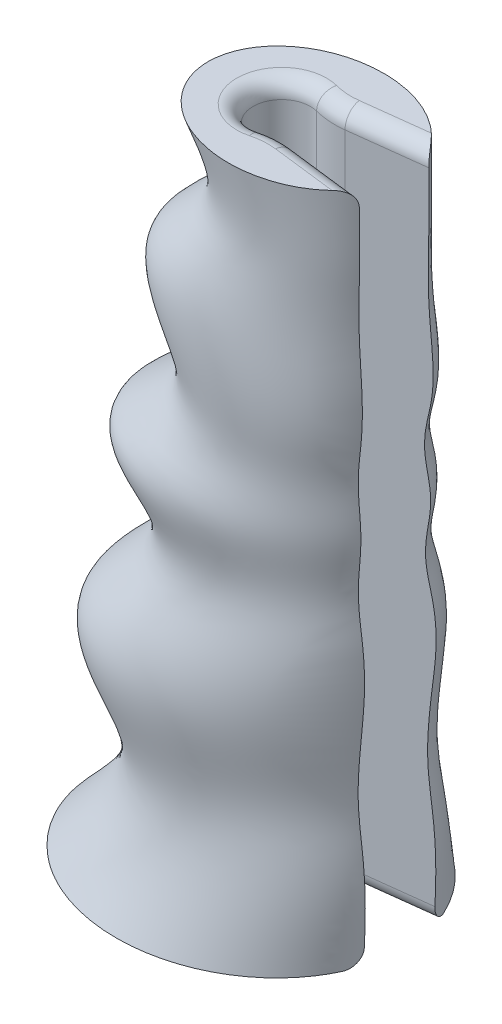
ISO-10303-21;
HEADER;
FILE_DESCRIPTION(('STEP AP214'),'2;1');
FILE_NAME('part.step','',(''),(''),'','','');
FILE_SCHEMA(('AUTOMOTIVE_DESIGN { 1 0 10303 214 1 1 1 1 }'));
ENDSEC;
DATA;
#1=APPLICATION_CONTEXT('core data for automotive mechanical design processes');
#2=APPLICATION_PROTOCOL_DEFINITION('international standard','automotive_design',2000,#1);
#3=PRODUCT_CONTEXT('',#1,'mechanical');
#4=PRODUCT('Part','Part','',(#3));
#5=PRODUCT_RELATED_PRODUCT_CATEGORY('part','',(#4));
#6=PRODUCT_DEFINITION_FORMATION('','',#4);
#7=PRODUCT_DEFINITION_CONTEXT('part definition',#1,'design');
#8=PRODUCT_DEFINITION('design','',#6,#7);
#9=PRODUCT_DEFINITION_SHAPE('','',#8);
#10=(LENGTH_UNIT() NAMED_UNIT(*) SI_UNIT(.MILLI.,.METRE.));
#11=(NAMED_UNIT(*) PLANE_ANGLE_UNIT() SI_UNIT($,.RADIAN.));
#12=(NAMED_UNIT(*) SI_UNIT($,.STERADIAN.) SOLID_ANGLE_UNIT());
#13=UNCERTAINTY_MEASURE_WITH_UNIT(LENGTH_MEASURE(1.E-05),#10,'distance_accuracy_value','');
#14=(GEOMETRIC_REPRESENTATION_CONTEXT(3) GLOBAL_UNCERTAINTY_ASSIGNED_CONTEXT((#13)) GLOBAL_UNIT_ASSIGNED_CONTEXT((#10,
#11,#12)) REPRESENTATION_CONTEXT('',''));
#15=CARTESIAN_POINT('',(0.,0.,0.));
#16=DIRECTION('',(0.,0.,1.));
#17=DIRECTION('',(1.,0.,0.));
#18=AXIS2_PLACEMENT_3D('',#15,#16,#17);
#19=CARTESIAN_POINT('',(-12.,82.,0.));
#20=DIRECTION('',(0.,1.,0.));
#21=DIRECTION('',(0.,0.,1.));
#22=AXIS2_PLACEMENT_3D('',#19,#20,#21);
#23=PLANE('',#22);
#24=CARTESIAN_POINT('',(-11.5906361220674,82.,-13.0623978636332));
#25=DIRECTION('',(0.,1.,0.));
#26=DIRECTION('',(0.,0.,1.));
#27=AXIS2_PLACEMENT_3D('',#24,#25,#26);
#28=CIRCLE('',#27,8.);
#29=CARTESIAN_POINT('',(-13.610999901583,82.,-5.32171764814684));
#30=VERTEX_POINT('',#29);
#31=CARTESIAN_POINT('',(-10.6279730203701,82.,-5.12052908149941));
#32=VERTEX_POINT('',#31);
#33=EDGE_CURVE('E296',#30,#32,#28,.T.);
#34=ORIENTED_EDGE('',*,*,#33,.T.);
#35=DIRECTION('',(-0.992733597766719,0.,0.120332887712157));
#36=VECTOR('',#35,1.);
#37=CARTESIAN_POINT('',(-1.50205834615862,82.,-6.2267147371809));
#38=LINE('',#37,#36);
#39=CARTESIAN_POINT('',(-2.77060193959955,82.,-6.07296878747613));
#40=VERTEX_POINT('',#39);
#41=EDGE_CURVE('E144',#32,#40,#38,.F.);
#42=ORIENTED_EDGE('',*,*,#41,.T.);
#43=CARTESIAN_POINT('',(-12.,82.,0.));
#44=DIRECTION('',(0.,1.,0.));
#45=DIRECTION('',(1.,0.,0.));
#46=AXIS2_PLACEMENT_3D('',#43,#44,#45);
#47=ELLIPSE('',#46,12.,9.5);
#48=CARTESIAN_POINT('',(-2.77020868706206,82.,6.07332426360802));
#49=VERTEX_POINT('',#48);
#50=EDGE_CURVE('E174',#40,#49,#47,.T.);
#51=ORIENTED_EDGE('',*,*,#50,.T.);
#52=DIRECTION('',(0.992733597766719,0.,0.120332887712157));
#53=VECTOR('',#52,1.);
#54=CARTESIAN_POINT('',(-10.6279730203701,82.,5.12052908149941));
#55=LINE('',#54,#53);
#56=CARTESIAN_POINT('',(-10.6279730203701,82.,5.12052908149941));
#57=VERTEX_POINT('',#56);
#58=EDGE_CURVE('E299',#49,#57,#55,.F.);
#59=ORIENTED_EDGE('',*,*,#58,.T.);
#60=CARTESIAN_POINT('',(-11.5906361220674,82.,13.0623978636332));
#61=DIRECTION('',(0.,1.,0.));
#62=DIRECTION('',(0.,0.,1.));
#63=AXIS2_PLACEMENT_3D('',#60,#61,#62);
#64=CIRCLE('',#63,8.);
#65=CARTESIAN_POINT('',(-13.610999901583,82.,5.32171764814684));
#66=VERTEX_POINT('',#65);
#67=EDGE_CURVE('E303',#57,#66,#64,.T.);
#68=ORIENTED_EDGE('',*,*,#67,.T.);
#69=CARTESIAN_POINT('',(-15.,82.,0.));
#70=DIRECTION('',(0.,1.,0.));
#71=DIRECTION('',(0.,0.,1.));
#72=AXIS2_PLACEMENT_3D('',#69,#70,#71);
#73=CIRCLE('',#72,5.5);
#74=EDGE_CURVE('E169',#66,#30,#73,.F.);
#75=ORIENTED_EDGE('',*,*,#74,.T.);
#76=EDGE_LOOP('',(#34,#42,#51,#59,#68,#75));
#77=FACE_BOUND('',#76,.T.);
#78=ADVANCED_FACE('F45',(#77),#23,.T.);
#79=CARTESIAN_POINT('',(-18.75,0.,0.));
#80=DIRECTION('',(0.,1.,0.));
#81=DIRECTION('',(0.,0.,1.));
#82=AXIS2_PLACEMENT_3D('',#79,#80,#81);
#83=PLANE('',#82);
#84=CARTESIAN_POINT('',(-11.5906361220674,0.,13.0623978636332));
#85=DIRECTION('',(0.,1.,0.));
#86=DIRECTION('',(0.,0.,1.));
#87=AXIS2_PLACEMENT_3D('',#84,#85,#86);
#88=CIRCLE('',#87,8.);
#89=CARTESIAN_POINT('',(-13.610999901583,0.,5.32171764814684));
#90=VERTEX_POINT('',#89);
#91=CARTESIAN_POINT('',(-10.6279730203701,0.,5.12052908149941));
#92=VERTEX_POINT('',#91);
#93=EDGE_CURVE('E64',#90,#92,#88,.F.);
#94=ORIENTED_EDGE('',*,*,#93,.T.);
#95=DIRECTION('',(-0.992733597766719,0.,-0.120332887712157));
#96=VECTOR('',#95,1.);
#97=CARTESIAN_POINT('',(-19.2440837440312,0.,4.07613863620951));
#98=LINE('',#97,#96);
#99=CARTESIAN_POINT('',(-1.39249269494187,0.,6.24000748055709));
#100=VERTEX_POINT('',#99);
#101=EDGE_CURVE('E390',#92,#100,#98,.F.);
#102=ORIENTED_EDGE('',*,*,#101,.T.);
#103=CARTESIAN_POINT('',(-18.75,0.,0.));
#104=DIRECTION('',(0.,1.,0.));
#105=DIRECTION('',(-1.,0.,0.));
#106=AXIS2_PLACEMENT_3D('',#103,#104,#105);
#107=ELLIPSE('',#106,18.75,16.5);
#108=CARTESIAN_POINT('',(-1.39092477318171,0.,-6.24073400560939));
#109=VERTEX_POINT('',#108);
#110=EDGE_CURVE('E50',#109,#100,#107,.T.);
#111=ORIENTED_EDGE('',*,*,#110,.F.);
#112=DIRECTION('',(0.992733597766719,0.,-0.120332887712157));
#113=VECTOR('',#112,1.);
#114=CARTESIAN_POINT('',(-19.2440837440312,0.,-4.07613863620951));
#115=LINE('',#114,#113);
#116=CARTESIAN_POINT('',(-10.6279730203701,0.,-5.12052908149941));
#117=VERTEX_POINT('',#116);
#118=EDGE_CURVE('E71',#109,#117,#115,.F.);
#119=ORIENTED_EDGE('',*,*,#118,.T.);
#120=CARTESIAN_POINT('',(-11.5906361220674,0.,-13.0623978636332));
#121=DIRECTION('',(0.,1.,0.));
#122=DIRECTION('',(0.,0.,1.));
#123=AXIS2_PLACEMENT_3D('',#120,#121,#122);
#124=CIRCLE('',#123,8.);
#125=CARTESIAN_POINT('',(-13.610999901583,0.,-5.32171764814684));
#126=VERTEX_POINT('',#125);
#127=EDGE_CURVE('E362',#117,#126,#124,.F.);
#128=ORIENTED_EDGE('',*,*,#127,.T.);
#129=CARTESIAN_POINT('',(-15.,0.,0.));
#130=DIRECTION('',(0.,1.,0.));
#131=DIRECTION('',(0.,0.,1.));
#132=AXIS2_PLACEMENT_3D('',#129,#130,#131);
#133=CIRCLE('',#132,5.5);
#134=EDGE_CURVE('E383',#126,#90,#133,.T.);
#135=ORIENTED_EDGE('',*,*,#134,.T.);
#136=EDGE_LOOP('',(#94,#102,#111,#119,#128,#135));
#137=FACE_BOUND('',#136,.T.);
#138=ADVANCED_FACE('F208',(#137),#83,.F.);
#139=CARTESIAN_POINT('',(-30.1206109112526,0.,-13.1197259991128));
#140=CARTESIAN_POINT('',(-25.2682820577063,4.25892901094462,-12.7615274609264));
#141=CARTESIAN_POINT('',(-15.4435202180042,12.88220341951,-12.0362643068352));
#142=CARTESIAN_POINT('',(-9.8822150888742,22.9866608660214,-12.9841875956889));
#143=CARTESIAN_POINT('',(-4.1118260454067,35.9479921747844,-9.52553941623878));
#144=CARTESIAN_POINT('',(-27.4130643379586,45.1096973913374,-13.2063022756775));
#145=CARTESIAN_POINT('',(-2.85239676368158,53.4177742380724,-8.92608836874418));
#146=CARTESIAN_POINT('',(-9.97331779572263,65.1476364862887,-10.1500206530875));
#147=CARTESIAN_POINT('',(-6.15639617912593,73.0152902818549,-8.01891358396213));
#148=CARTESIAN_POINT('',(-6.75895793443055,79.0867182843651,-8.44767636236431));
#149=CARTESIAN_POINT('',(-7.04808796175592,82.,-8.65341161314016));
#150=CARTESIAN_POINT('',(-30.5320298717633,0.,-12.8435991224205));
#151=CARTESIAN_POINT('',(-25.672440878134,4.25892901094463,-12.5565557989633));
#152=CARTESIAN_POINT('',(-15.8329790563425,12.8822034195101,-11.9753642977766));
#153=CARTESIAN_POINT('',(-10.3667198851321,22.9866608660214,-13.2156432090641));
#154=CARTESIAN_POINT('',(-4.38254320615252,35.9479921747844,-9.67969448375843));
#155=CARTESIAN_POINT('',(-27.9485059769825,45.1096973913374,-13.0263826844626));
#156=CARTESIAN_POINT('',(-3.08011458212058,53.4177742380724,-9.08491013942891));
#157=CARTESIAN_POINT('',(-10.3846765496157,65.1476364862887,-10.2735476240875));
#158=CARTESIAN_POINT('',(-6.38969544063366,73.0152902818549,-8.09001235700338));
#159=CARTESIAN_POINT('',(-7.03843772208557,79.0867182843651,-8.54383458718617));
#160=CARTESIAN_POINT('',(-7.34972676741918,82.,-8.76159423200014));
#161=CARTESIAN_POINT('',(-31.3216528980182,0.,-12.2671462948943));
#162=CARTESIAN_POINT('',(-26.4538231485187,4.25892901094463,-12.1218772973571));
#163=CARTESIAN_POINT('',(-16.5976758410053,12.8822034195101,-11.8277436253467));
#164=CARTESIAN_POINT('',(-11.3512543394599,22.9866608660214,-13.6451100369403));
#165=CARTESIAN_POINT('',(-4.93308272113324,35.9479921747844,-9.96376329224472));
#166=CARTESIAN_POINT('',(-28.9914244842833,45.1096973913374,-12.6403405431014));
#167=CARTESIAN_POINT('',(-3.5451748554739,53.4177742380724,-9.37956758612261));
#168=CARTESIAN_POINT('',(-11.2142088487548,65.1476364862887,-10.4955373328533));
#169=CARTESIAN_POINT('',(-6.85778120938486,73.0152902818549,-8.21290657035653));
#170=CARTESIAN_POINT('',(-7.60154193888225,79.0867182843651,-8.71541565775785));
#171=CARTESIAN_POINT('',(-7.95842413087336,82.,-8.95653694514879));
#172=CARTESIAN_POINT('',(-32.4055292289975,0.,-11.335840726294));
#173=CARTESIAN_POINT('',(-27.5435369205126,4.25892901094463,-11.4008666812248));
#174=CARTESIAN_POINT('',(-17.6992089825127,12.8822034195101,-11.5325281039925));
#175=CARTESIAN_POINT('',(-12.8672579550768,22.9866608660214,-14.1901639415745));
#176=CARTESIAN_POINT('',(-5.78203847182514,35.9479921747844,-10.3181596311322));
#177=CARTESIAN_POINT('',(-30.468960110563,45.1096973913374,-11.9877615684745));
#178=CARTESIAN_POINT('',(-4.26790574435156,53.4177742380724,-9.75341414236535));
#179=CARTESIAN_POINT('',(-12.4734257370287,65.1476364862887,-10.7547941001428));
#180=CARTESIAN_POINT('',(-7.56151161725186,73.0152902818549,-8.34074309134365));
#181=CARTESIAN_POINT('',(-8.45493376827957,79.0867182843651,-8.91186256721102));
#182=CARTESIAN_POINT('',(-8.88362870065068,82.,-9.18590549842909));
#183=CARTESIAN_POINT('',(-33.3879338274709,0.,-10.343879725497));
#184=CARTESIAN_POINT('',(-28.5493375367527,4.25892901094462,-10.6160758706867));
#185=CARTESIAN_POINT('',(-18.752380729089,12.88220341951,-11.1672055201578));
#186=CARTESIAN_POINT('',(-14.4150908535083,22.9866608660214,-14.637258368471));
#187=CARTESIAN_POINT('',(-6.6499715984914,35.9479921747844,-10.6018662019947));
#188=CARTESIAN_POINT('',(-31.8567057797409,45.1096973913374,-11.2667599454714));
#189=CARTESIAN_POINT('',(-5.01204368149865,53.4177742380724,-10.0599397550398));
#190=CARTESIAN_POINT('',(-13.7420351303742,65.1476364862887,-10.9417879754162));
#191=CARTESIAN_POINT('',(-8.26398379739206,73.0152902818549,-8.41348001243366));
#192=CARTESIAN_POINT('',(-9.31336268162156,79.0867182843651,-9.0486662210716));
#193=CARTESIAN_POINT('',(-9.8168910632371,82.,-9.35345059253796));
#194=CARTESIAN_POINT('',(-38.668049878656,0.,-4.06400649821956));
#195=CARTESIAN_POINT('',(-34.0713411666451,4.25892901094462,-5.55592585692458));
#196=CARTESIAN_POINT('',(-24.7641466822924,12.88220341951,-8.57669234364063));
#197=CARTESIAN_POINT('',(-23.8488280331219,22.9866608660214,-16.7391892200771));
#198=CARTESIAN_POINT('',(-11.9464200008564,35.9479921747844,-11.8860696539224));
#199=CARTESIAN_POINT('',(-39.6267531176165,45.1096973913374,-6.56077300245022));
#200=CARTESIAN_POINT('',(-9.58291301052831,53.4177742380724,-11.5000797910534));
#201=CARTESIAN_POINT('',(-21.3768909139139,65.1476364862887,-11.6389632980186));
#202=CARTESIAN_POINT('',(-12.4541076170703,73.0152902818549,-8.52773513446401));
#203=CARTESIAN_POINT('',(-14.4719681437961,79.0867182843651,-9.51931725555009));
#204=CARTESIAN_POINT('',(-15.4402076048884,82.,-9.99511274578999));
#205=CARTESIAN_POINT('',(-38.6792682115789,0.,4.21335863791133));
#206=CARTESIAN_POINT('',(-35.0950938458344,4.25892901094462,1.79303026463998));
#207=CARTESIAN_POINT('',(-27.8380301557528,12.88220341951,-3.10753409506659));
#208=CARTESIAN_POINT('',(-33.5813470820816,22.9866608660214,-14.1202987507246));
#209=CARTESIAN_POINT('',(-17.461074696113,35.9479921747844,-9.79201917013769));
#210=CARTESIAN_POINT('',(-42.3562746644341,45.1096973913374,0.68882444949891));
#211=CARTESIAN_POINT('',(-14.5712975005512,53.4177742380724,-9.696451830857));
#212=CARTESIAN_POINT('',(-28.507662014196,65.1476364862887,-8.95786309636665));
#213=CARTESIAN_POINT('',(-16.07533050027,73.0152902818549,-6.1170462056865));
#214=CARTESIAN_POINT('',(-19.2303228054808,79.0867182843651,-7.21444966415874));
#215=CARTESIAN_POINT('',(-20.7441975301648,82.,-7.74102190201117));
#216=CARTESIAN_POINT('',(-27.3831687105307,0.,17.247111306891));
#217=CARTESIAN_POINT('',(-26.5228914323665,4.25892901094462,14.470931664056));
#218=CARTESIAN_POINT('',(-24.781043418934,12.88220341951,8.84985678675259));
#219=CARTESIAN_POINT('',(-44.5070571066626,22.9866608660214,-1.22119630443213));
#220=CARTESIAN_POINT('',(-23.7567864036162,35.9479921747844,-0.328900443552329));
#221=CARTESIAN_POINT('',(-34.4227648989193,45.1096973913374,13.8085860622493));
#222=CARTESIAN_POINT('',(-20.7386438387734,53.4177742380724,-0.828855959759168));
#223=CARTESIAN_POINT('',(-34.9609841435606,65.1476364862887,1.12564465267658));
#224=CARTESIAN_POINT('',(-18.6809629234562,73.0152902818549,1.8493195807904));
#225=CARTESIAN_POINT('',(-23.3995284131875,79.0867182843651,1.17786922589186));
#226=CARTESIAN_POINT('',(-25.6636597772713,82.,0.855684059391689));
#227=CARTESIAN_POINT('',(-15.6077682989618,0.,18.6422635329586));
#228=CARTESIAN_POINT('',(-16.093965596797,4.25892901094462,16.8609607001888));
#229=CARTESIAN_POINT('',(-17.0783944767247,12.88220341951,13.2542644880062));
#230=CARTESIAN_POINT('',(-41.567867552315,22.9866608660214,8.35507532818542));
#231=CARTESIAN_POINT('',(-22.2006483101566,35.9479921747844,6.44243806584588));
#232=CARTESIAN_POINT('',(-22.1502154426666,45.1096973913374,16.8046940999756));
#233=CARTESIAN_POINT('',(-19.8228079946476,53.4177742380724,5.74965295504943));
#234=CARTESIAN_POINT('',(-31.1922720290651,65.1476364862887,7.6794812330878));
#235=CARTESIAN_POINT('',(-16.0680208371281,73.0152902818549,6.59693812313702));
#236=CARTESIAN_POINT('',(-20.7419667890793,79.0867182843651,6.52451186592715));
#237=CARTESIAN_POINT('',(-22.9846881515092,82.,6.48975923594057));
#238=CARTESIAN_POINT('',(0.848990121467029,0.,7.597188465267));
#239=CARTESIAN_POINT('',(0.0723872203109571,4.25892901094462,8.66209422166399));
#240=CARTESIAN_POINT('',(-1.50004094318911,12.88220341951,10.8182641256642));
#241=CARTESIAN_POINT('',(-22.1876757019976,22.9866608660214,17.6132998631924));
#242=CARTESIAN_POINT('',(-11.3719618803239,35.9479921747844,12.6086407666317));
#243=CARTESIAN_POINT('',(-0.732549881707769,45.1096973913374,9.60791045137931));
#244=CARTESIAN_POINT('',(-10.7140952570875,53.4177742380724,12.1025237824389));
#245=CARTESIAN_POINT('',(-14.7379218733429,65.1476364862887,12.6205600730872));
#246=CARTESIAN_POINT('',(-6.73605037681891,73.0152902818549,9.44088904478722));
#247=CARTESIAN_POINT('',(-9.56277528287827,79.0867182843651,10.3708408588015));
#248=CARTESIAN_POINT('',(-10.9191359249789,82.,10.8170639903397));
#249=CARTESIAN_POINT('',(2.43439037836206,0.,-2.7651638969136));
#250=CARTESIAN_POINT('',(2.76848953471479,4.25892901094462,-0.384374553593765));
#251=CARTESIAN_POINT('',(3.44495742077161,12.88220341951,4.43613308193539));
#252=CARTESIAN_POINT('',(-9.39260741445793,22.9866608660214,15.5535323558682));
#253=CARTESIAN_POINT('',(-4.13657996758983,35.9479921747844,10.8434768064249));
#254=CARTESIAN_POINT('',(4.38332874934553,45.1096973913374,0.7689268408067));
#255=CARTESIAN_POINT('',(-4.2348115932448,53.4177742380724,10.681740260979));
#256=CARTESIAN_POINT('',(-5.14778852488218,65.1476364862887,10.0782528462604));
#257=CARTESIAN_POINT('',(-1.77261599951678,73.0152902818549,7.00219795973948));
#258=CARTESIAN_POINT('',(-3.14425123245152,79.0867182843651,8.14692954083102));
#259=CARTESIAN_POINT('',(-3.80240938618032,82.,8.69621145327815));
#260=CARTESIAN_POINT('',(-8.86170912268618,0.,-15.7989165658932));
#261=CARTESIAN_POINT('',(-5.80371287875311,4.25892901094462,-13.0622759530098));
#262=CARTESIAN_POINT('',(0.387970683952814,12.88220341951,-7.52125779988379));
#263=CARTESIAN_POINT('',(1.53310261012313,22.9866608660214,2.65442990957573));
#264=CARTESIAN_POINT('',(2.15913173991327,35.9479921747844,1.3803580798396));
#265=CARTESIAN_POINT('',(-3.55018101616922,45.1096973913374,-12.3508347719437));
#266=CARTESIAN_POINT('',(1.93253474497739,53.4177742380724,1.81414438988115));
#267=CARTESIAN_POINT('',(1.30553360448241,65.1476364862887,-0.00525490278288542));
#268=CARTESIAN_POINT('',(0.833016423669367,73.0152902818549,-0.964167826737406));
#269=CARTESIAN_POINT('',(1.02495437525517,79.0867182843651,-0.245389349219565));
#270=CARTESIAN_POINT('',(1.11705286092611,82.,0.0995054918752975));
#271=CARTESIAN_POINT('',(-17.9358352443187,0.,-17.9785856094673));
#272=CARTESIAN_POINT('',(-13.7049793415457,4.25892901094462,-15.8848530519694));
#273=CARTESIAN_POINT('',(-5.13854601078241,12.88220341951,-11.6455641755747));
#274=CARTESIAN_POINT('',(0.566326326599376,22.9866608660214,-5.07568336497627));
#275=CARTESIAN_POINT('',(1.69555283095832,35.9479921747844,-4.11789109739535));
#276=CARTESIAN_POINT('',(-12.6447905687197,45.1096973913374,-15.6272768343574));
#277=CARTESIAN_POINT('',(1.89223796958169,53.4177742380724,-3.49673683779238));
#278=CARTESIAN_POINT('',(-0.647710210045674,65.1476364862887,-5.41419506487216));
#279=CARTESIAN_POINT('',(-0.697696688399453,73.0152902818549,-4.94492742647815));
#280=CARTESIAN_POINT('',(-0.388429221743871,79.0867182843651,-4.67371423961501));
#281=CARTESIAN_POINT('',(-0.240031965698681,82.,-4.54357674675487));
#282=CARTESIAN_POINT('',(-26.2144243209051,0.,-15.158433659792));
#283=CARTESIAN_POINT('',(-21.5024159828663,4.25892901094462,-14.1899660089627));
#284=CARTESIAN_POINT('',(-11.9617683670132,12.88220341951,-12.2290593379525));
#285=CARTESIAN_POINT('',(-5.96725520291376,22.9866608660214,-10.601593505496));
#286=CARTESIAN_POINT('',(-1.92974158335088,35.9479921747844,-7.91401525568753));
#287=CARTESIAN_POINT('',(-22.5207342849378,45.1096973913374,-14.4038416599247));
#288=CARTESIAN_POINT('',(-1.04155108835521,53.4177742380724,-7.29072007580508));
#289=CARTESIAN_POINT('',(-6.56957538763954,65.1476364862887,-8.78796915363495));
#290=CARTESIAN_POINT('',(-4.1961730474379,73.0152902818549,-7.17380033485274));
#291=CARTESIAN_POINT('',(-4.44034732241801,79.0867182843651,-7.37204942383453));
#292=CARTESIAN_POINT('',(-4.55751060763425,82.,-7.46717621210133));
#293=CARTESIAN_POINT('',(-27.5613391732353,0.,-14.5870546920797));
#294=CARTESIAN_POINT('',(-22.7848302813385,4.25892901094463,-13.814274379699));
#295=CARTESIAN_POINT('',(-13.1135850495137,12.8822034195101,-12.2495860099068));
#296=CARTESIAN_POINT('',(-7.16252982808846,22.9866608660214,-11.4649249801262));
#297=CARTESIAN_POINT('',(-2.59452038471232,35.9479921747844,-8.50308420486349));
#298=CARTESIAN_POINT('',(-24.164483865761,45.1096973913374,-14.1061974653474));
#299=CARTESIAN_POINT('',(-1.5866768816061,53.4177742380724,-7.88339132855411));
#300=CARTESIAN_POINT('',(-7.62994457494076,65.1476364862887,-9.3003445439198));
#301=CARTESIAN_POINT('',(-4.81456490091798,73.0152902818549,-7.50360138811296));
#302=CARTESIAN_POINT('',(-5.16424146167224,79.0867182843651,-7.77966215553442));
#303=CARTESIAN_POINT('',(-5.3320284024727,82.,-7.91212568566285));
#304=CARTESIAN_POINT('',(-28.8686189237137,0.,-13.9135181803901));
#305=CARTESIAN_POINT('',(-24.0440768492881,4.25892901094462,-13.3439951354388));
#306=CARTESIAN_POINT('',(-14.2755763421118,12.88220341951,-12.1908522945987));
#307=CARTESIAN_POINT('',(-8.46245523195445,22.9866608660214,-12.2650849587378));
#308=CARTESIAN_POINT('',(-3.31896558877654,35.9479921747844,-9.04463302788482));
#309=CARTESIAN_POINT('',(-25.7989208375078,45.1096973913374,-13.7130885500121));
#310=CARTESIAN_POINT('',(-2.18743591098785,53.4177742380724,-8.43261268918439));
#311=CARTESIAN_POINT('',(-8.76153384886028,65.1476364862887,-9.75902325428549));
#312=CARTESIAN_POINT('',(-5.46676361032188,73.0152902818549,-7.78898904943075));
#313=CARTESIAN_POINT('',(-5.93517874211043,79.0867182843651,-8.14208429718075));
#314=CARTESIAN_POINT('',(-6.15994056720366,82.,-8.31151164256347));
#315=CARTESIAN_POINT('',(-29.7091919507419,0.,-13.3958528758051));
#316=CARTESIAN_POINT('',(-24.8641232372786,4.25892901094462,-12.9664991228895));
#317=CARTESIAN_POINT('',(-15.0540613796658,12.88220341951,-12.0971643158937));
#318=CARTESIAN_POINT('',(-9.39771029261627,22.9866608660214,-12.7527319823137));
#319=CARTESIAN_POINT('',(-3.84110888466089,35.9479921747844,-9.37138434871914));
#320=CARTESIAN_POINT('',(-26.8776226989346,45.1096973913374,-13.3862218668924));
#321=CARTESIAN_POINT('',(-2.62467894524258,53.4177742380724,-8.76726659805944));
#322=CARTESIAN_POINT('',(-9.56195904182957,65.1476364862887,-10.0264936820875));
#323=CARTESIAN_POINT('',(-5.92309691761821,73.0152902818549,-7.94781481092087));
#324=CARTESIAN_POINT('',(-6.47947814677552,79.0867182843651,-8.35151813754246));
#325=CARTESIAN_POINT('',(-6.74644915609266,82.,-8.54522899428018));
#326=CARTESIAN_POINT('',(-30.1206109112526,0.,-13.1197259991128));
#327=CARTESIAN_POINT('',(-25.2682820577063,4.25892901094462,-12.7615274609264));
#328=CARTESIAN_POINT('',(-15.4435202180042,12.88220341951,-12.0362643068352));
#329=CARTESIAN_POINT('',(-9.8822150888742,22.9866608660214,-12.9841875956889));
#330=CARTESIAN_POINT('',(-4.1118260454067,35.9479921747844,-9.52553941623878));
#331=CARTESIAN_POINT('',(-27.4130643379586,45.1096973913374,-13.2063022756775));
#332=CARTESIAN_POINT('',(-2.85239676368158,53.4177742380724,-8.92608836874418));
#333=CARTESIAN_POINT('',(-9.97331779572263,65.1476364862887,-10.1500206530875));
#334=CARTESIAN_POINT('',(-6.15639617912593,73.0152902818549,-8.01891358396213));
#335=CARTESIAN_POINT('',(-6.75895793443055,79.0867182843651,-8.44767636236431));
#336=CARTESIAN_POINT('',(-7.04808796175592,82.,-8.65341161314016));
#337=B_SPLINE_SURFACE_WITH_KNOTS('',3,3,((#139,#140,#141,#142,#143,#144,#145,#146,#147,#148,
#149),(#150,#151,#152,#153,#154,#155,#156,#157,#158,#159,#160),(#161,#162,#163,#164,#165,#166,
#167,#168,#169,#170,#171),(#172,#173,#174,#175,#176,#177,#178,#179,#180,#181,#182),(#183,#184,
#185,#186,#187,#188,#189,#190,#191,#192,#193),(#194,#195,#196,#197,#198,#199,#200,#201,#202,
#203,#204),(#205,#206,#207,#208,#209,#210,#211,#212,#213,#214,#215),(#216,#217,#218,#219,#220,
#221,#222,#223,#224,#225,#226),(#227,#228,#229,#230,#231,#232,#233,#234,#235,#236,#237),(#238,
#239,#240,#241,#242,#243,#244,#245,#246,#247,#248),(#249,#250,#251,#252,#253,#254,#255,#256,
#257,#258,#259),(#260,#261,#262,#263,#264,#265,#266,#267,#268,#269,#270),(#271,#272,#273,#274,
#275,#276,#277,#278,#279,#280,#281),(#282,#283,#284,#285,#286,#287,#288,#289,#290,#291,#292),
(#293,#294,#295,#296,#297,#298,#299,#300,#301,#302,#303),(#304,#305,#306,#307,#308,#309,#310,
#311,#312,#313,#314),(#315,#316,#317,#318,#319,#320,#321,#322,#323,#324,#325),(#326,#327,#328,
#329,#330,#331,#332,#333,#334,#335,#336)),.UNSPECIFIED.,.T.,.F.,.F.,(4,1,1,1,1,2,2,2,1,1,1,1,4),
(4,1,1,1,1,1,1,1,4),(0.,0.0125,0.0249999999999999,0.0375000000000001,0.05,0.25,0.5,0.75,0.95,
0.9625,0.975,0.9875,1.),(0.,0.162529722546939,0.329082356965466,0.444037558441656,
0.57699853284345,0.710011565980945,0.814613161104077,0.911044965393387,1.),.UNSPECIFIED.);
#338=CARTESIAN_POINT('',(-2.77058153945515,82.0000000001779,-6.07299038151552));
#339=CARTESIAN_POINT('',(-2.70931045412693,81.9999980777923,-6.0145153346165));
#340=CARTESIAN_POINT('',(-2.64873251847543,81.9967906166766,-5.95526129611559));
#341=CARTESIAN_POINT('',(-2.52929891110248,81.9835414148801,-5.83558219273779));
#342=CARTESIAN_POINT('',(-2.47044655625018,81.9734873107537,-5.77515520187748));
#343=CARTESIAN_POINT('',(-2.3546916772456,81.9460395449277,-5.65338164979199));
#344=CARTESIAN_POINT('',(-2.29780238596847,81.9286038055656,-5.59203179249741));
#345=CARTESIAN_POINT('',(-2.18689938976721,81.8860169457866,-5.46951415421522));
#346=CARTESIAN_POINT('',(-2.13288335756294,81.8608721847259,-5.40834626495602));
#347=CARTESIAN_POINT('',(-2.00367284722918,81.7888306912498,-5.25851239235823));
#348=CARTESIAN_POINT('',(-1.93039044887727,81.7372609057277,-5.17036723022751));
#349=CARTESIAN_POINT('',(-1.79301962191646,81.6163317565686,-4.99968253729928));
#350=CARTESIAN_POINT('',(-1.72890662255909,81.5470213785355,-4.91712834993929));
#351=CARTESIAN_POINT('',(-1.6108637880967,81.3904371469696,-4.76072166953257));
#352=CARTESIAN_POINT('',(-1.55701005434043,81.3030383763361,-4.68693562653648));
#353=CARTESIAN_POINT('',(-1.46146680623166,81.1123549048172,-4.5530184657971));
#354=CARTESIAN_POINT('',(-1.41978149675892,81.0090647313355,-4.49289206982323));
#355=CARTESIAN_POINT('',(-1.3535402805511,80.8023328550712,-4.39603483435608));
#356=CARTESIAN_POINT('',(-1.32758751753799,80.7002075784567,-4.35743630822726));
#357=CARTESIAN_POINT('',(-1.28648573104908,80.489296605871,-4.29627618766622));
#358=CARTESIAN_POINT('',(-1.27131660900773,80.3805237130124,-4.27368475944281));
#359=CARTESIAN_POINT('',(-1.25768885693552,80.2255710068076,-4.25403010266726));
#360=CARTESIAN_POINT('',(-1.25465615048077,80.1805768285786,-4.24977393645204));
#361=CARTESIAN_POINT('',(-1.25039944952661,80.0903981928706,-4.24412645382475));
#362=CARTESIAN_POINT('',(-1.24917249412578,80.0452141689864,-4.24273044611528));
#363=CARTESIAN_POINT('',(-1.2488439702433,80.,-4.24276860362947));
#364=B_SPLINE_CURVE_WITH_KNOTS('',3,(#338,#339,#340,#341,#342,#343,#344,#345,#346,#347,#348,
#349,#350,#351,#352,#353,#354,#355,#356,#357,#358,#359,#360,#361,#362,#363),.UNSPECIFIED.,.F.,
.F.,(4,2,2,2,2,2,2,2,2,2,2,2,4),(0.,0.254075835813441,0.508611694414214,0.764618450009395,
1.02041458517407,1.39586046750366,1.77028064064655,2.14737839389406,2.52460630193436,
2.85952345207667,3.19381473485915,3.32960258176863,3.46516752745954),.UNSPECIFIED.);
#365=CARTESIAN_POINT('',(-1.2488439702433,80.,-4.24276860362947));
#366=VERTEX_POINT('',#365);
#367=EDGE_CURVE('E262',#40,#366,#364,.T.);
#368=CARTESIAN_POINT('',(-0.649531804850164,0.,-4.31541343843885));
#369=CARTESIAN_POINT('',(-0.638623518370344,0.34236441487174,-4.31673566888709));
#370=CARTESIAN_POINT('',(-0.626074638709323,0.684665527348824,-4.31825676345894));
#371=CARTESIAN_POINT('',(-0.599731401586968,1.3695180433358,-4.32144992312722));
#372=CARTESIAN_POINT('',(-0.585935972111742,1.71206940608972,-4.32312211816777));
#373=CARTESIAN_POINT('',(-0.559154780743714,2.39737445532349,-4.32636836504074));
#374=CARTESIAN_POINT('',(-0.54616942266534,2.74012815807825,-4.32794236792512));
#375=CARTESIAN_POINT('',(-0.522786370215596,3.42578562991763,-4.33077671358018));
#376=CARTESIAN_POINT('',(-0.512389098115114,3.76868941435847,-4.33203700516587));
#377=CARTESIAN_POINT('',(-0.495727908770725,4.45458483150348,-4.33405656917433));
#378=CARTESIAN_POINT('',(-0.489463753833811,4.79757645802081,-4.33481587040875));
#379=CARTESIAN_POINT('',(-0.482326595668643,5.48357543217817,-4.3356809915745));
#380=CARTESIAN_POINT('',(-0.481452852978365,5.82658277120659,-4.33578690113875));
#381=CARTESIAN_POINT('',(-0.486026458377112,6.51290986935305,-4.33523251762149));
#382=CARTESIAN_POINT('',(-0.491480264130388,6.85622958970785,-4.33457144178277));
#383=CARTESIAN_POINT('',(-0.509277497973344,7.5425715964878,-4.33241417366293));
#384=CARTESIAN_POINT('',(-0.521618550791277,7.88559394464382,-4.33091826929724));
#385=CARTESIAN_POINT('',(-0.553275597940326,8.57123520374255,-4.32708100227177));
#386=CARTESIAN_POINT('',(-0.572590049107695,8.91385418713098,-4.32473982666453));
#387=CARTESIAN_POINT('',(-0.617968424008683,9.5986066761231,-4.31923934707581));
#388=CARTESIAN_POINT('',(-0.644031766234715,9.94074022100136,-4.31608011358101));
#389=CARTESIAN_POINT('',(-0.702631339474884,10.6244452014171,-4.30897704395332));
#390=CARTESIAN_POINT('',(-0.735167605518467,10.9660166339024,-4.30503320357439));
#391=CARTESIAN_POINT('',(-0.78834170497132,11.4779072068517,-4.29858777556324));
#392=CARTESIAN_POINT('',(-0.806794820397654,11.6484607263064,-4.29635100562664));
#393=CARTESIAN_POINT('',(-0.84503878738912,11.9894151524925,-4.29171531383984));
#394=CARTESIAN_POINT('',(-0.864829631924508,12.1598160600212,-4.28931639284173));
#395=CARTESIAN_POINT('',(-0.90060432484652,12.4580489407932,-4.28498001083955));
#396=CARTESIAN_POINT('',(-0.916308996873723,12.5859150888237,-4.28307638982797));
#397=CARTESIAN_POINT('',(-0.948198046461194,12.8415866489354,-4.27921100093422));
#398=CARTESIAN_POINT('',(-0.964382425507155,12.9693920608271,-4.27724923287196));
#399=CARTESIAN_POINT('',(-1.01303667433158,13.3527813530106,-4.27135167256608));
#400=CARTESIAN_POINT('',(-1.04560938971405,13.6083520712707,-4.26740341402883));
#401=CARTESIAN_POINT('',(-1.10845998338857,14.1197453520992,-4.25978506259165));
#402=CARTESIAN_POINT('',(-1.13873822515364,14.3755678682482,-4.25611492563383));
#403=CARTESIAN_POINT('',(-1.19501255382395,14.8876884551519,-4.24929370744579));
#404=CARTESIAN_POINT('',(-1.22100883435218,15.1439865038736,-4.24614260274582));
#405=CARTESIAN_POINT('',(-1.26723466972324,15.6558791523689,-4.24053939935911));
#406=CARTESIAN_POINT('',(-1.28749126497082,15.9114712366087,-4.23808402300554));
#407=CARTESIAN_POINT('',(-1.32163897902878,16.4231602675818,-4.23394485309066));
#408=CARTESIAN_POINT('',(-1.33552836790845,16.6792573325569,-4.23226126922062));
#409=CARTESIAN_POINT('',(-1.35669027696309,17.1917513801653,-4.22969615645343));
#410=CARTESIAN_POINT('',(-1.36396222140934,17.4481483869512,-4.22881469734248));
#411=CARTESIAN_POINT('',(-1.37206805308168,17.9610199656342,-4.22783215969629));
#412=CARTESIAN_POINT('',(-1.37290247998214,18.2174945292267,-4.22773101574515));
#413=CARTESIAN_POINT('',(-1.36789211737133,18.8159202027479,-4.22833834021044));
#414=CARTESIAN_POINT('',(-1.35972695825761,19.1578515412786,-4.22932806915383));
#415=CARTESIAN_POINT('',(-1.33438798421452,19.8413628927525,-4.23239949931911));
#416=CARTESIAN_POINT('',(-1.31721398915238,20.182942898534,-4.23448122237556));
#417=CARTESIAN_POINT('',(-1.27561908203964,20.8656644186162,-4.23952309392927));
#418=CARTESIAN_POINT('',(-1.25119772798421,21.2068059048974,-4.24248329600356));
#419=CARTESIAN_POINT('',(-1.19658813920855,21.8906490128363,-4.249102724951));
#420=CARTESIAN_POINT('',(-1.1663665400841,22.2333478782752,-4.25276599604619));
#421=CARTESIAN_POINT('',(-1.10167545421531,22.9183090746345,-4.2606074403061));
#422=CARTESIAN_POINT('',(-1.06720626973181,23.2605714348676,-4.26478557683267));
#423=CARTESIAN_POINT('',(-1.01315283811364,23.7737064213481,-4.27133759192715));
#424=CARTESIAN_POINT('',(-0.994743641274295,23.9447063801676,-4.27356903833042));
#425=CARTESIAN_POINT('',(-0.957251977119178,24.2866312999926,-4.27811354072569));
#426=CARTESIAN_POINT('',(-0.938169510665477,24.4575562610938,-4.2804265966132));
#427=CARTESIAN_POINT('',(-0.904253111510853,24.7567613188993,-4.28453772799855));
#428=CARTESIAN_POINT('',(-0.889545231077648,24.8850559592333,-4.28632052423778));
#429=CARTESIAN_POINT('',(-0.859842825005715,25.1416115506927,-4.28992086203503));
#430=CARTESIAN_POINT('',(-0.84484829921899,25.2698725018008,-4.29173840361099));
#431=CARTESIAN_POINT('',(-0.799790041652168,25.6546448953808,-4.29720008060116));
#432=CARTESIAN_POINT('',(-0.769651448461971,25.9111474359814,-4.30085329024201));
#433=CARTESIAN_POINT('',(-0.710870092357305,26.4243330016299,-4.30797839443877));
#434=CARTESIAN_POINT('',(-0.682227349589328,26.6810160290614,-4.31145028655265));
#435=CARTESIAN_POINT('',(-0.627997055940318,27.1947523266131,-4.31802373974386));
#436=CARTESIAN_POINT('',(-0.602409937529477,27.4518056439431,-4.32112524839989));
#437=CARTESIAN_POINT('',(-0.556013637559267,27.9636694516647,-4.32674911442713));
#438=CARTESIAN_POINT('',(-0.535157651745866,28.2184755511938,-4.32927714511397));
#439=CARTESIAN_POINT('',(-0.499246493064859,28.7285162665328,-4.33363006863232));
#440=CARTESIAN_POINT('',(-0.484191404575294,28.9837508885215,-4.33545495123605));
#441=CARTESIAN_POINT('',(-0.461156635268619,29.4945294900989,-4.33824708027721));
#442=CARTESIAN_POINT('',(-0.453176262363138,29.7500734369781,-4.33921441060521));
#443=CARTESIAN_POINT('',(-0.445434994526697,30.2613482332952,-4.34015275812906));
#444=CARTESIAN_POINT('',(-0.445675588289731,30.5170791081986,-4.34012359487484));
#445=CARTESIAN_POINT('',(-0.454389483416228,30.9790684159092,-4.33906735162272));
#446=CARTESIAN_POINT('',(-0.461266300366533,31.1853575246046,-4.33823378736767));
#447=CARTESIAN_POINT('',(-0.481343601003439,31.5976810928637,-4.33580014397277));
#448=CARTESIAN_POINT('',(-0.494545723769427,31.8037154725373,-4.33419986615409));
#449=CARTESIAN_POINT('',(-0.527457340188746,32.2152389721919,-4.33021052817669));
#450=CARTESIAN_POINT('',(-0.547166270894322,32.4207281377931,-4.32782153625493));
#451=CARTESIAN_POINT('',(-0.593048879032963,32.8308930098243,-4.32225993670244));
#452=CARTESIAN_POINT('',(-0.619220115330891,33.0355689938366,-4.31908762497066));
#453=CARTESIAN_POINT('',(-0.677707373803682,33.4438641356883,-4.31199816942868));
#454=CARTESIAN_POINT('',(-0.7100186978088,33.6474839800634,-4.3080815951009));
#455=CARTESIAN_POINT('',(-0.780496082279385,34.055479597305,-4.29953877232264));
#456=CARTESIAN_POINT('',(-0.818709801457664,34.2598469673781,-4.29490674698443));
#457=CARTESIAN_POINT('',(-0.879507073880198,34.5656856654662,-4.28753728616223));
#458=CARTESIAN_POINT('',(-0.900352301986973,34.6675132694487,-4.28501055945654));
#459=CARTESIAN_POINT('',(-0.943047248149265,34.8709549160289,-4.27983534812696));
#460=CARTESIAN_POINT('',(-0.964896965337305,34.9725689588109,-4.2771868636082));
#461=CARTESIAN_POINT('',(-1.03159680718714,35.2772112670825,-4.26910193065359));
#462=CARTESIAN_POINT('',(-1.07758619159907,35.4799834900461,-4.2635273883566));
#463=CARTESIAN_POINT('',(-1.16911308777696,35.8856526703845,-4.25243307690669));
#464=CARTESIAN_POINT('',(-1.21465055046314,36.0885496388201,-4.24691331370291));
#465=CARTESIAN_POINT('',(-1.30190853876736,36.4952107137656,-4.23633645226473));
#466=CARTESIAN_POINT('',(-1.34362893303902,36.6989748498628,-4.23127936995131));
#467=CARTESIAN_POINT('',(-1.40569027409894,37.030882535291,-4.22375668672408));
#468=CARTESIAN_POINT('',(-1.42816710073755,37.1586169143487,-4.22103218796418));
#469=CARTESIAN_POINT('',(-1.46972254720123,37.4146316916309,-4.21599509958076));
#470=CARTESIAN_POINT('',(-1.48880167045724,37.5429120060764,-4.21368244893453));
#471=CARTESIAN_POINT('',(-1.52297863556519,37.7999809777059,-4.20953973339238));
#472=CARTESIAN_POINT('',(-1.53807751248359,37.928769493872,-4.20770954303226));
#473=CARTESIAN_POINT('',(-1.56386130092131,38.186795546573,-4.2045841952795));
#474=CARTESIAN_POINT('',(-1.57454629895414,38.316033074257,-4.20328902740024));
#475=CARTESIAN_POINT('',(-1.59121108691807,38.5743867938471,-4.20126902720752));
#476=CARTESIAN_POINT('',(-1.59720637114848,38.7035019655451,-4.20054231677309));
#477=CARTESIAN_POINT('',(-1.60448697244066,38.9619103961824,-4.19965980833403));
#478=CARTESIAN_POINT('',(-1.60577068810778,39.0912037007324,-4.19950420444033));
#479=CARTESIAN_POINT('',(-1.60376067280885,39.3497370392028,-4.19974784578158));
#480=CARTESIAN_POINT('',(-1.60046745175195,39.4789770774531,-4.20014702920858));
#481=CARTESIAN_POINT('',(-1.58963470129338,39.7371745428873,-4.20146010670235));
#482=CARTESIAN_POINT('',(-1.58209835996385,39.8661321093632,-4.20237361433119));
#483=CARTESIAN_POINT('',(-1.56215163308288,40.1389740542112,-4.20479143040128));
#484=CARTESIAN_POINT('',(-1.54927080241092,40.2828229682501,-4.20635276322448));
#485=CARTESIAN_POINT('',(-1.51966328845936,40.5701236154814,-4.20994159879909));
#486=CARTESIAN_POINT('',(-1.50293625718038,40.7135753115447,-4.21196914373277));
#487=CARTESIAN_POINT('',(-1.44842035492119,41.1436042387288,-4.21857721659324));
#488=CARTESIAN_POINT('',(-1.40631780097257,41.4296103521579,-4.22368062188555));
#489=CARTESIAN_POINT('',(-1.31918286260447,42.0017957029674,-4.23424256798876));
#490=CARTESIAN_POINT('',(-1.27414387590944,42.2879737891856,-4.23970190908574));
#491=CARTESIAN_POINT('',(-1.19053384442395,42.859276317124,-4.24983658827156));
#492=CARTESIAN_POINT('',(-1.1519185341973,43.1443934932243,-4.2545172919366));
#493=CARTESIAN_POINT('',(-1.10493971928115,43.5730263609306,-4.26021176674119));
#494=CARTESIAN_POINT('',(-1.09111267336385,43.7159174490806,-4.26188779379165));
#495=CARTESIAN_POINT('',(-1.06803597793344,44.0020666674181,-4.26468500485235));
#496=CARTESIAN_POINT('',(-1.05878583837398,44.1453247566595,-4.2658062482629));
#497=CARTESIAN_POINT('',(-1.04573824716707,44.4316713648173,-4.26738779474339));
#498=CARTESIAN_POINT('',(-1.04192430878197,44.5747590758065,-4.26785009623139));
#499=CARTESIAN_POINT('',(-1.04074156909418,44.7894064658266,-4.26799346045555));
#500=CARTESIAN_POINT('',(-1.04110366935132,44.8609578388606,-4.26794956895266));
#501=CARTESIAN_POINT('',(-1.04340757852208,45.0040347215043,-4.26767030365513));
#502=CARTESIAN_POINT('',(-1.04534937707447,45.0755602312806,-4.26743493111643));
#503=CARTESIAN_POINT('',(-1.0527447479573,45.2701369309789,-4.2665385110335));
#504=CARTESIAN_POINT('',(-1.05972122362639,45.3931314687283,-4.26569286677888));
#505=CARTESIAN_POINT('',(-1.07782852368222,45.6388061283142,-4.26349801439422));
#506=CARTESIAN_POINT('',(-1.08895951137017,45.7614862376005,-4.26214878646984));
#507=CARTESIAN_POINT('',(-1.11485530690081,46.0067984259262,-4.25900986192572));
#508=CARTESIAN_POINT('',(-1.12963019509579,46.1294294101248,-4.25721894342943));
#509=CARTESIAN_POINT('',(-1.16213594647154,46.3742869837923,-4.25327880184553));
#510=CARTESIAN_POINT('',(-1.17986678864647,46.4965135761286,-4.25112958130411));
#511=CARTESIAN_POINT('',(-1.23648700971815,46.8630969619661,-4.24426643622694));
#512=CARTESIAN_POINT('',(-1.27875223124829,47.1069143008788,-4.23914331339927));
#513=CARTESIAN_POINT('',(-1.36624473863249,47.5952856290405,-4.22853802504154));
#514=CARTESIAN_POINT('',(-1.41148638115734,47.8398367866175,-4.22305411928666));
#515=CARTESIAN_POINT('',(-1.49803920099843,48.3292058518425,-4.21256273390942));
#516=CARTESIAN_POINT('',(-1.53935787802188,48.5740223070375,-4.20755434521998));
#517=CARTESIAN_POINT('',(-1.59370080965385,48.9423081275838,-4.20096723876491));
#518=CARTESIAN_POINT('',(-1.61053721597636,49.0651958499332,-4.19892643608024));
#519=CARTESIAN_POINT('',(-1.64097003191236,49.3113739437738,-4.19523756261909));
#520=CARTESIAN_POINT('',(-1.65456667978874,49.4346642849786,-4.19358946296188));
#521=CARTESIAN_POINT('',(-1.67788552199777,49.6814379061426,-4.19076290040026));
#522=CARTESIAN_POINT('',(-1.68761342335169,49.8049206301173,-4.18958374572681));
#523=CARTESIAN_POINT('',(-1.70275096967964,50.0522255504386,-4.18774886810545));
#524=CARTESIAN_POINT('',(-1.70815829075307,50.1760478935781,-4.18709342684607));
#525=CARTESIAN_POINT('',(-1.71434306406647,50.4238039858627,-4.18634374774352));
#526=CARTESIAN_POINT('',(-1.71512082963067,50.5477377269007,-4.18624947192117));
#527=CARTESIAN_POINT('',(-1.71194383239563,50.7958849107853,-4.18663456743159));
#528=CARTESIAN_POINT('',(-1.70797603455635,50.9200981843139,-4.18711551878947));
#529=CARTESIAN_POINT('',(-1.69540043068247,51.1682814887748,-4.18863985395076));
#530=CARTESIAN_POINT('',(-1.68679269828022,51.2922515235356,-4.18968322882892));
#531=CARTESIAN_POINT('',(-1.66525211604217,51.5398140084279,-4.1922942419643));
#532=CARTESIAN_POINT('',(-1.65231895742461,51.6634064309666,-4.1938619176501));
#533=CARTESIAN_POINT('',(-1.62265526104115,51.9097590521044,-4.19745756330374));
#534=CARTESIAN_POINT('',(-1.60593582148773,52.0325206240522,-4.19948418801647));
#535=CARTESIAN_POINT('',(-1.56928687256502,52.2775603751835,-4.20392654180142));
#536=CARTESIAN_POINT('',(-1.54935713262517,52.3998385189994,-4.20634229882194));
#537=CARTESIAN_POINT('',(-1.48573644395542,52.7662501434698,-4.21405399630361));
#538=CARTESIAN_POINT('',(-1.438247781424,53.0097036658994,-4.21981027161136));
#539=CARTESIAN_POINT('',(-1.33914464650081,53.4959250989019,-4.2318229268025));
#540=CARTESIAN_POINT('',(-1.28752668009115,53.7386922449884,-4.23807973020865));
#541=CARTESIAN_POINT('',(-1.21160296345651,54.1030833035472,-4.24728272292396));
#542=CARTESIAN_POINT('',(-1.1865539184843,54.2245454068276,-4.25031900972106));
#543=CARTESIAN_POINT('',(-1.13766487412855,54.4677164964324,-4.25624503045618));
#544=CARTESIAN_POINT('',(-1.11382485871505,54.5894254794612,-4.25913476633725));
#545=CARTESIAN_POINT('',(-1.06809961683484,54.833013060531,-4.26467729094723));
#546=CARTESIAN_POINT('',(-1.04621125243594,54.9548910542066,-4.26733046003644));
#547=CARTESIAN_POINT('',(-1.0049108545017,55.1990735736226,-4.2723366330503));
#548=CARTESIAN_POINT('',(-0.985498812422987,55.3213780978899,-4.27468963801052));
#549=CARTESIAN_POINT('',(-0.949269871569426,55.5662286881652,-4.27908108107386));
#550=CARTESIAN_POINT('',(-0.932449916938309,55.6887742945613,-4.28111988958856));
#551=CARTESIAN_POINT('',(-0.901440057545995,55.934202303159,-4.2848787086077));
#552=CARTESIAN_POINT('',(-0.887250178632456,56.0570847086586,-4.28659871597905));
#553=CARTESIAN_POINT('',(-0.848781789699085,56.4246399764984,-4.2912616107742));
#554=CARTESIAN_POINT('',(-0.828380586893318,56.6697346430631,-4.29373451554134));
#555=CARTESIAN_POINT('',(-0.797308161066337,57.1610702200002,-4.29750091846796));
#556=CARTESIAN_POINT('',(-0.786658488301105,57.4073124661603,-4.29879180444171));
#557=CARTESIAN_POINT('',(-0.773993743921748,57.9005819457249,-4.30032694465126));
#558=CARTESIAN_POINT('',(-0.771998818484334,58.1476096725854,-4.30056875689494));
#559=CARTESIAN_POINT('',(-0.77529851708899,58.6420840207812,-4.30016878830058));
#560=CARTESIAN_POINT('',(-0.780607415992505,58.889530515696,-4.29952527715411));
#561=CARTESIAN_POINT('',(-0.797055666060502,59.3844830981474,-4.29753152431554));
#562=CARTESIAN_POINT('',(-0.808201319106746,59.6319889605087,-4.29618051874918));
#563=CARTESIAN_POINT('',(-0.83485349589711,60.1267008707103,-4.29294991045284));
#564=CARTESIAN_POINT('',(-0.85035909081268,60.3739069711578,-4.29107042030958));
#565=CARTESIAN_POINT('',(-0.887643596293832,60.9161632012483,-4.28655102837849));
#566=CARTESIAN_POINT('',(-0.910056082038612,61.2111679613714,-4.28383432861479));
#567=CARTESIAN_POINT('',(-0.956892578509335,61.8004976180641,-4.27815710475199));
#568=CARTESIAN_POINT('',(-0.981313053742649,62.0948228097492,-4.27519700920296));
#569=CARTESIAN_POINT('',(-1.03019402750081,62.6831090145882,-4.26927196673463));
#570=CARTESIAN_POINT('',(-1.05465444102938,62.9770700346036,-4.26630703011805));
#571=CARTESIAN_POINT('',(-1.10181096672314,63.5649266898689,-4.26059101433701));
#572=CARTESIAN_POINT('',(-1.12450833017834,63.8588222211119,-4.25783978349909));
#573=CARTESIAN_POINT('',(-1.16639479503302,64.4468453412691,-4.25276257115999));
#574=CARTESIAN_POINT('',(-1.1855842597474,64.7409729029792,-4.25043654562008));
#575=CARTESIAN_POINT('',(-1.21876329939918,65.3306704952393,-4.24641479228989));
#576=CARTESIAN_POINT('',(-1.23273246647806,65.6262417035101,-4.24472153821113));
#577=CARTESIAN_POINT('',(-1.2559867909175,66.2177583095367,-4.24190279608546));
#578=CARTESIAN_POINT('',(-1.26526889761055,66.5137038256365,-4.24077767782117));
#579=CARTESIAN_POINT('',(-1.27974937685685,67.1058414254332,-4.23902244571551));
#580=CARTESIAN_POINT('',(-1.28494571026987,67.4020335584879,-4.23839257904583));
#581=CARTESIAN_POINT('',(-1.29193066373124,67.9945319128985,-4.23754590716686));
#582=CARTESIAN_POINT('',(-1.29371840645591,68.2908381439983,-4.23732920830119));
#583=CARTESIAN_POINT('',(-1.2946107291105,68.8834324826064,-4.23722104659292));
#584=CARTESIAN_POINT('',(-1.29371549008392,69.1797205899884,-4.23732956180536));
#585=CARTESIAN_POINT('',(-1.29022318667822,69.7369537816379,-4.23775287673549));
#586=CARTESIAN_POINT('',(-1.28784177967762,69.9979004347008,-4.23804153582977));
#587=CARTESIAN_POINT('',(-1.28211365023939,70.5197172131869,-4.23873586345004));
#588=CARTESIAN_POINT('',(-1.27876716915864,70.7805873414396,-4.23914150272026));
#589=CARTESIAN_POINT('',(-1.27162793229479,71.3022877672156,-4.24000687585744));
#590=CARTESIAN_POINT('',(-1.26783523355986,71.563118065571,-4.24046660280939));
#591=CARTESIAN_POINT('',(-1.26030926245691,72.0847754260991,-4.24137885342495));
#592=CARTESIAN_POINT('',(-1.25657598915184,72.3456024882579,-4.24183137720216));
#593=CARTESIAN_POINT('',(-1.24963601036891,72.8673400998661,-4.24267259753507));
#594=CARTESIAN_POINT('',(-1.24642945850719,73.1282506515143,-4.24306127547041));
#595=CARTESIAN_POINT('',(-1.24102780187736,73.6500990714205,-4.24371603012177));
#596=CARTESIAN_POINT('',(-1.23883276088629,73.9110369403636,-4.24398209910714));
#597=CARTESIAN_POINT('',(-1.2353557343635,74.4329278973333,-4.24440356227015));
#598=CARTESIAN_POINT('',(-1.23407378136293,74.6938809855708,-4.24455895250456));
#599=CARTESIAN_POINT('',(-1.23226877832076,75.2157910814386,-4.24477774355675));
#600=CARTESIAN_POINT('',(-1.231745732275,75.4767480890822,-4.24484114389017));
#601=CARTESIAN_POINT('',(-1.23134233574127,75.9985969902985,-4.24489004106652));
#602=CARTESIAN_POINT('',(-1.23146182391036,76.2594888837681,-4.24487555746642));
#603=CARTESIAN_POINT('',(-1.23223520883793,76.7812675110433,-4.24478181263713));
#604=CARTESIAN_POINT('',(-1.23288909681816,77.0421542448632,-4.24470255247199));
#605=CARTESIAN_POINT('',(-1.23463541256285,77.5639238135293,-4.24449087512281));
#606=CARTESIAN_POINT('',(-1.23572783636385,77.8248066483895,-4.2443584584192));
#607=CARTESIAN_POINT('',(-1.23826296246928,78.3465696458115,-4.24405116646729));
#608=CARTESIAN_POINT('',(-1.23970566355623,78.6074498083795,-4.24387629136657));
#609=CARTESIAN_POINT('',(-1.24285958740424,79.1293020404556,-4.24349399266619));
#610=CARTESIAN_POINT('',(-1.24457090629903,79.3902741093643,-4.2432865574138));
#611=CARTESIAN_POINT('',(-1.248183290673,79.9122178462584,-4.2428486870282));
#612=CARTESIAN_POINT('',(-1.25008435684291,80.173189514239,-4.24261825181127));
#613=CARTESIAN_POINT('',(-1.25400034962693,80.6951334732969,-4.24214357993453));
#614=CARTESIAN_POINT('',(-1.25601527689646,80.9561057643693,-4.2418993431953));
#615=CARTESIAN_POINT('',(-1.2600842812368,81.4780519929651,-4.24140612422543));
#616=CARTESIAN_POINT('',(-1.26213835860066,81.7390259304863,-4.24115714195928));
#617=CARTESIAN_POINT('',(-1.26417464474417,82.,-4.24091031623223));
#618=B_SPLINE_CURVE_WITH_KNOTS('',3,(#368,#369,#370,#371,#372,#373,#374,#375,#376,#377,#378,
#379,#380,#381,#382,#383,#384,#385,#386,#387,#388,#389,#390,#391,#392,#393,#394,#395,#396,#397,
#398,#399,#400,#401,#402,#403,#404,#405,#406,#407,#408,#409,#410,#411,#412,#413,#414,#415,#416,
#417,#418,#419,#420,#421,#422,#423,#424,#425,#426,#427,#428,#429,#430,#431,#432,#433,#434,#435,
#436,#437,#438,#439,#440,#441,#442,#443,#444,#445,#446,#447,#448,#449,#450,#451,#452,#453,#454,
#455,#456,#457,#458,#459,#460,#461,#462,#463,#464,#465,#466,#467,#468,#469,#470,#471,#472,#473,
#474,#475,#476,#477,#478,#479,#480,#481,#482,#483,#484,#485,#486,#487,#488,#489,#490,#491,#492,
#493,#494,#495,#496,#497,#498,#499,#500,#501,#502,#503,#504,#505,#506,#507,#508,#509,#510,#511,
#512,#513,#514,#515,#516,#517,#518,#519,#520,#521,#522,#523,#524,#525,#526,#527,#528,#529,#530,
#531,#532,#533,#534,#535,#536,#537,#538,#539,#540,#541,#542,#543,#544,#545,#546,#547,#548,#549,
#550,#551,#552,#553,#554,#555,#556,#557,#558,#559,#560,#561,#562,#563,#564,#565,#566,#567,#568,
#569,#570,#571,#572,#573,#574,#575,#576,#577,#578,#579,#580,#581,#582,#583,#584,#585,#586,#587,
#588,#589,#590,#591,#592,#593,#594,#595,#596,#597,#598,#599,#600,#601,#602,#603,#604,#605,#606,
#607,#608,#609,#610,#611,#612,#613,#614,#615,#616,#617),.UNSPECIFIED.,.F.,.F.,(4,2,2,2,2,2,2,2,
2,2,2,2,2,2,2,2,2,2,2,2,2,2,2,2,2,2,2,2,2,2,2,2,2,2,2,2,2,2,2,2,2,2,2,2,2,2,2,2,2,2,2,2,2,2,2,2,
2,2,2,2,2,2,2,2,2,2,2,2,2,2,2,2,2,2,2,2,2,2,2,2,2,2,2,2,2,2,2,2,2,2,2,2,2,2,2,2,2,2,2,2,2,2,2,2,
2,2,2,2,2,2,2,2,2,2,2,2,2,2,2,2,2,2,2,2,4),(0.,1.02760559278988,2.05610347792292,
3.08511003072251,4.11428436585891,5.14339950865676,6.17237347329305,7.20239849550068,
8.23206850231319,9.26151078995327,10.2908644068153,11.32022359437,11.8349097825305,
12.3495932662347,12.736114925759,13.1226377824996,13.8956418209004,14.6685231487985,
15.4413695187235,16.2105119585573,16.9798632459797,17.7492814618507,18.518635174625,
19.5445730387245,20.5705314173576,21.596552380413,22.6286624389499,23.6606990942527,
24.1767056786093,24.692711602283,25.0801530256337,25.467594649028,26.2424731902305,
27.0173621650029,27.7923606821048,28.5593208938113,29.3262922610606,30.0931885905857,
30.8602237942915,31.4793492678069,32.0986352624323,32.7178676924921,33.33686656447,
33.9553936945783,34.5792048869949,34.8911110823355,35.2030170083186,35.8270010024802,
36.4510520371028,37.0751245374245,37.4642634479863,37.8533446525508,38.2423245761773,
38.6312968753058,39.0189785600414,39.4067920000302,39.7945622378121,40.1820415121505,
40.6152738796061,41.0485454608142,41.9158255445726,42.7851277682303,43.6481663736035,
44.0788091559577,44.5094058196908,44.938693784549,45.1533354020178,45.3679756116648,
45.7374743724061,46.1069876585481,46.4775348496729,46.8480794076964,47.5905058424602,
48.3368213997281,49.0816801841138,49.4538017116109,49.8258958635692,50.1974390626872,
50.5691819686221,50.940899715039,51.3136408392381,51.6863760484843,52.0591378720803,
52.4308208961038,52.8025306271,53.5467274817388,54.2915608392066,54.6637226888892,
55.0358796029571,55.4074269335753,55.7789729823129,56.1500776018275,56.5211858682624,
57.2588148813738,57.9980701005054,58.73904520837,59.4814705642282,60.2246991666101,
60.9677695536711,61.8553542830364,62.7414083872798,63.6263831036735,64.5107238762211,
65.3949730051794,66.2826436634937,67.1708913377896,68.0595820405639,68.9485014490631,
69.8373608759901,70.6202312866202,71.4029060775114,72.1854809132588,72.9680433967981,
73.7508337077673,74.5336733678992,75.3165409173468,76.0994125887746,76.8820876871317,
77.6647499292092,78.4474050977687,79.2300575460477,80.0129907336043,80.7959267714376,
81.5788673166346,82.3618137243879),.UNSPECIFIED.);
#619=CARTESIAN_POINT('',(-0.57468664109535,2.00000000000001,-4.32448569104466));
#620=VERTEX_POINT('',#619);
#621=EDGE_CURVE('E168',#620,#366,#618,.T.);
#622=CARTESIAN_POINT('',(-0.574686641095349,2.,-4.32448569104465));
#623=CARTESIAN_POINT('',(-0.576874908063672,1.94419962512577,-4.32421943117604));
#624=CARTESIAN_POINT('',(-0.579814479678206,1.88844415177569,-4.32621762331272));
#625=CARTESIAN_POINT('',(-0.58715112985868,1.77738214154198,-4.33470713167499));
#626=CARTESIAN_POINT('',(-0.591547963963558,1.72207553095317,-4.34119769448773));
#627=CARTESIAN_POINT('',(-0.60683598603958,1.55757860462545,-4.36731731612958));
#628=CARTESIAN_POINT('',(-0.619834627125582,1.44956510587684,-4.3935934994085));
#629=CARTESIAN_POINT('',(-0.651126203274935,1.23991459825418,-4.46303146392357));
#630=CARTESIAN_POINT('',(-0.669419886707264,1.13827849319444,-4.50619563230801));
#631=CARTESIAN_POINT('',(-0.700608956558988,0.992803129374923,-4.58244568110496));
#632=CARTESIAN_POINT('',(-0.711632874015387,0.945464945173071,-4.60978685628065));
#633=CARTESIAN_POINT('',(-0.73492031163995,0.853351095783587,-4.66811545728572));
#634=CARTESIAN_POINT('',(-0.747184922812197,0.808577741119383,-4.69910609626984));
#635=CARTESIAN_POINT('',(-0.786039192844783,0.677794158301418,-4.79779552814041));
#636=CARTESIAN_POINT('',(-0.814500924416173,0.596207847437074,-4.87074510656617));
#637=CARTESIAN_POINT('',(-0.876127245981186,0.447091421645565,-5.02812492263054));
#638=CARTESIAN_POINT('',(-0.909292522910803,0.379563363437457,-5.11255683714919));
#639=CARTESIAN_POINT('',(-0.96261359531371,0.289538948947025,-5.24649323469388));
#640=CARTESIAN_POINT('',(-0.981167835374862,0.261204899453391,-5.29280762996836));
#641=CARTESIAN_POINT('',(-1.01934682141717,0.208768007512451,-5.38730378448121));
#642=CARTESIAN_POINT('',(-1.03897058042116,0.184661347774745,-5.43548381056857));
#643=CARTESIAN_POINT('',(-1.07924657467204,0.140777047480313,-5.53338232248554));
#644=CARTESIAN_POINT('',(-1.09989918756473,0.121001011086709,-5.58310137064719));
#645=CARTESIAN_POINT('',(-1.14215301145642,0.0858733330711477,-5.68368338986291));
#646=CARTESIAN_POINT('',(-1.16375427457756,0.0705219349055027,-5.73454642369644));
#647=CARTESIAN_POINT('',(-1.21808683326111,0.0382032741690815,-5.86090528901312));
#648=CARTESIAN_POINT('',(-1.2513215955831,0.0238057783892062,-5.936854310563));
#649=CARTESIAN_POINT('',(-1.31928010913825,0.0046770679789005,-6.08913621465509));
#650=CARTESIAN_POINT('',(-1.35400105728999,-7.15902616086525E-05,-6.16546815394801));
#651=CARTESIAN_POINT('',(-1.38932809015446,2.96217060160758E-07,-6.2414756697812));
#652=B_SPLINE_CURVE_WITH_KNOTS('',3,(#622,#623,#624,#625,#626,#627,#628,#629,#630,#631,#632,
#633,#634,#635,#636,#637,#638,#639,#640,#641,#642,#643,#644,#645,#646,#647,#648,#649,#650,#651),
.UNSPECIFIED.,.F.,.F.,(4,2,2,2,2,2,2,2,2,2,2,2,2,2,4),(0.,0.167429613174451,0.334831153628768,
0.668904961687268,1.00302600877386,1.17015919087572,1.33744064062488,1.67502583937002,
2.01266039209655,2.18462531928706,2.35643415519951,2.52830652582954,2.70018835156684,
2.95201949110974,3.20339495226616),.UNSPECIFIED.);
#653=EDGE_CURVE('E301',#620,#109,#652,.T.);
#654=CARTESIAN_POINT('',(-1.39245758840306,-7.09692721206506E-11,6.24002384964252));
#655=CARTESIAN_POINT('',(-1.3672706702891,5.15189835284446E-07,6.18557935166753));
#656=CARTESIAN_POINT('',(-1.34238037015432,0.00244396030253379,6.13102534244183));
#657=CARTESIAN_POINT('',(-1.29329299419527,0.0122478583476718,6.02203923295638));
#658=CARTESIAN_POINT('',(-1.26909601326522,0.019608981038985,5.96760715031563));
#659=CARTESIAN_POINT('',(-1.19772462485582,0.0491066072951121,5.8050717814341));
#660=CARTESIAN_POINT('',(-1.15174911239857,0.0786573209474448,5.69768451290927));
#661=CARTESIAN_POINT('',(-1.06386011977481,0.157150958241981,5.48832572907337));
#662=CARTESIAN_POINT('',(-1.02195246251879,0.206121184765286,5.38636206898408));
#663=CARTESIAN_POINT('',(-0.942859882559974,0.322324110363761,5.1914660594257));
#664=CARTESIAN_POINT('',(-0.905671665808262,0.389543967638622,5.09852742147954));
#665=CARTESIAN_POINT('',(-0.837303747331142,0.538498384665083,4.92716602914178));
#666=CARTESIAN_POINT('',(-0.805993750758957,0.619813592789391,4.84843055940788));
#667=CARTESIAN_POINT('',(-0.748489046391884,0.795849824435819,4.70530242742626));
#668=CARTESIAN_POINT('',(-0.722295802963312,0.890574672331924,4.64091387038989));
#669=CARTESIAN_POINT('',(-0.675833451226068,1.08830036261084,4.53009745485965));
#670=CARTESIAN_POINT('',(-0.655441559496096,1.19105971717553,4.48328933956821));
#671=CARTESIAN_POINT('',(-0.620068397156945,1.40369686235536,4.40722327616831));
#672=CARTESIAN_POINT('',(-0.605081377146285,1.51356694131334,4.37794665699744));
#673=CARTESIAN_POINT('',(-0.586278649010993,1.68700039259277,4.34689598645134));
#674=CARTESIAN_POINT('',(-0.580465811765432,1.74926557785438,4.33867690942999));
#675=CARTESIAN_POINT('',(-0.570661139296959,1.87433373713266,4.32796088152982));
#676=CARTESIAN_POINT('',(-0.566666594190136,1.93713576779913,4.32545539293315));
#677=CARTESIAN_POINT('',(-0.563606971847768,2.,4.32582869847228));
#678=B_SPLINE_CURVE_WITH_KNOTS('',3,(#654,#655,#656,#657,#658,#659,#660,#661,#662,#663,#664,
#665,#666,#667,#668,#669,#670,#671,#672,#673,#674,#675,#676,#677),.UNSPECIFIED.,.F.,.F.,(4,2,2,
2,2,2,2,2,2,2,2,4),(0.,0.179861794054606,0.359748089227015,0.719374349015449,1.07950802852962,
1.4393889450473,1.78998237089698,2.14067598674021,2.48327506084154,2.8255086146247,
3.01447257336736,3.20315398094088),.UNSPECIFIED.);
#679=CARTESIAN_POINT('',(-0.563606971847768,1.99999999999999,4.32582869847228));
#680=VERTEX_POINT('',#679);
#681=EDGE_CURVE('E373',#100,#680,#678,.T.);
#682=CARTESIAN_POINT('',(-1.26207063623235,82.,4.24116535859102));
#683=CARTESIAN_POINT('',(-1.26309313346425,81.6447669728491,4.24104141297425));
#684=CARTESIAN_POINT('',(-1.26335620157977,81.2895324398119,4.24100952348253));
#685=CARTESIAN_POINT('',(-1.26254344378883,80.5790276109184,4.2411080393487));
#686=CARTESIAN_POINT('',(-1.26146747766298,80.2237573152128,4.24123846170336));
#687=CARTESIAN_POINT('',(-1.25815634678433,79.5131947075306,4.24163981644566));
#688=CARTESIAN_POINT('',(-1.25592109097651,79.1579023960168,4.24191075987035));
#689=CARTESIAN_POINT('',(-1.25075684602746,78.4473078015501,4.2425367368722));
#690=CARTESIAN_POINT('',(-1.24782782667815,78.0920055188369,4.24289177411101));
#691=CARTESIAN_POINT('',(-1.24197083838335,77.3816774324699,4.24360172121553));
#692=CARTESIAN_POINT('',(-1.23904287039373,77.0266516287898,4.24395663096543));
#693=CARTESIAN_POINT('',(-1.2340893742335,76.3166088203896,4.24455706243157));
#694=CARTESIAN_POINT('',(-1.23206380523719,75.9615918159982,4.24480258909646));
#695=CARTESIAN_POINT('',(-1.22992569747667,75.2515753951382,4.24506175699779));
#696=CARTESIAN_POINT('',(-1.22981302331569,74.8965759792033,4.24507541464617));
#697=CARTESIAN_POINT('',(-1.23246018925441,74.1866038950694,4.24475454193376));
#698=CARTESIAN_POINT('',(-1.23521987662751,73.8316312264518,4.24442003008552));
#699=CARTESIAN_POINT('',(-1.24269912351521,73.2399627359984,4.2435134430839));
#700=CARTESIAN_POINT('',(-1.24645967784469,73.003254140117,4.24305761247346));
#701=CARTESIAN_POINT('',(-1.25495019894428,72.5298541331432,4.24202844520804));
#702=CARTESIAN_POINT('',(-1.25968017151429,72.2931627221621,4.24145510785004));
#703=CARTESIAN_POINT('',(-1.27434464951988,71.5830737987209,4.23967757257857));
#704=CARTESIAN_POINT('',(-1.28475326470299,71.1096866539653,4.23841590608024));
#705=CARTESIAN_POINT('',(-1.30141169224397,70.1628063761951,4.23639667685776));
#706=CARTESIAN_POINT('',(-1.30766135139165,69.6893132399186,4.23563913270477));
#707=CARTESIAN_POINT('',(-1.31186292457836,68.7417714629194,4.2351298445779));
#708=CARTESIAN_POINT('',(-1.30980607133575,68.2677227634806,4.23537916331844));
#709=CARTESIAN_POINT('',(-1.29522017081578,67.3197833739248,4.2371471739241));
#710=CARTESIAN_POINT('',(-1.28269130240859,66.8458926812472,4.23866584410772));
#711=CARTESIAN_POINT('',(-1.25571416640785,66.135422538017,4.24193584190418));
#712=CARTESIAN_POINT('',(-1.24535893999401,65.8986785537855,4.24319103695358));
#713=CARTESIAN_POINT('',(-1.22196418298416,65.425325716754,4.24602680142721));
#714=CARTESIAN_POINT('',(-1.2089246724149,65.1887168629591,4.24760736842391));
#715=CARTESIAN_POINT('',(-1.1802713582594,64.7150973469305,4.25108054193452));
#716=CARTESIAN_POINT('',(-1.16465152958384,64.4780870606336,4.25297387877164));
#717=CARTESIAN_POINT('',(-1.13199165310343,64.0041657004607,4.2569327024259));
#718=CARTESIAN_POINT('',(-1.1149515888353,63.767254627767,4.2589981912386));
#719=CARTESIAN_POINT('',(-1.06314883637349,63.0565153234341,4.26527739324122));
#720=CARTESIAN_POINT('',(-1.02770749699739,62.5827376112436,4.26957336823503));
#721=CARTESIAN_POINT('',(-0.961916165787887,61.6345984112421,4.27754817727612));
#722=CARTESIAN_POINT('',(-0.931568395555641,61.1602367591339,4.28122674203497));
#723=CARTESIAN_POINT('',(-0.88236857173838,60.2129333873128,4.28719043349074));
#724=CARTESIAN_POINT('',(-0.863466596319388,59.7399945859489,4.28948161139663));
#725=CARTESIAN_POINT('',(-0.847809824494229,59.0303573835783,4.29137942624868));
#726=CARTESIAN_POINT('',(-0.844706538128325,58.7938022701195,4.29175558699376));
#727=CARTESIAN_POINT('',(-0.843324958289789,58.3206808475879,4.29192305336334));
#728=CARTESIAN_POINT('',(-0.845046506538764,58.0841145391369,4.29171437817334));
#729=CARTESIAN_POINT('',(-0.853804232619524,57.6112531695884,4.29065282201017));
#730=CARTESIAN_POINT('',(-0.860836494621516,57.3749580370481,4.28980041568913));
#731=CARTESIAN_POINT('',(-0.880520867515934,56.9026104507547,4.28741440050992));
#732=CARTESIAN_POINT('',(-0.89317281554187,56.6665579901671,4.28588081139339));
#733=CARTESIAN_POINT('',(-0.924186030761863,56.1942753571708,4.28212158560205));
#734=CARTESIAN_POINT('',(-0.942560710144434,55.9580460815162,4.27989432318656));
#735=CARTESIAN_POINT('',(-0.984706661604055,55.4860205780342,4.27478565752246));
#736=CARTESIAN_POINT('',(-1.00847924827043,55.2502244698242,4.27190409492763));
#737=CARTESIAN_POINT('',(-1.0606930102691,54.7790990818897,4.26557507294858));
#738=CARTESIAN_POINT('',(-1.08913558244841,54.5437699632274,4.26212744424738));
#739=CARTESIAN_POINT('',(-1.14726529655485,54.0733400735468,4.25508132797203));
#740=CARTESIAN_POINT('',(-1.17695210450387,53.8382392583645,4.25148288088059));
#741=CARTESIAN_POINT('',(-1.23410292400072,53.3678278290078,4.24455542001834));
#742=CARTESIAN_POINT('',(-1.26156763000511,53.1325173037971,4.2412263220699));
#743=CARTESIAN_POINT('',(-1.31110440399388,52.6613298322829,4.23522178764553));
#744=CARTESIAN_POINT('',(-1.3331772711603,52.4254529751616,4.23254625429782));
#745=CARTESIAN_POINT('',(-1.36433236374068,52.0197456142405,4.22876983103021));
#746=CARTESIAN_POINT('',(-1.37532277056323,51.8500658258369,4.22743764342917));
#747=CARTESIAN_POINT('',(-1.39266419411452,51.5104161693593,4.22533562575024));
#748=CARTESIAN_POINT('',(-1.39901397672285,51.3404462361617,4.22456594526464));
#749=CARTESIAN_POINT('',(-1.40679373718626,51.0003935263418,4.22362293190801));
#750=CARTESIAN_POINT('',(-1.40822377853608,50.8303107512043,4.22344959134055));
#751=CARTESIAN_POINT('',(-1.40624696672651,50.4902179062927,4.22368920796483));
#752=CARTESIAN_POINT('',(-1.4028412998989,50.3202078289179,4.22410202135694));
#753=CARTESIAN_POINT('',(-1.39159592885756,49.9798151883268,4.22546511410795));
#754=CARTESIAN_POINT('',(-1.38374254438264,49.8094330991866,4.22641705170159));
#755=CARTESIAN_POINT('',(-1.36430537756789,49.468882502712,4.22877310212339));
#756=CARTESIAN_POINT('',(-1.35272140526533,49.2987140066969,4.23017723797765));
#757=CARTESIAN_POINT('',(-1.32675773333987,48.9585559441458,4.23332439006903));
#758=CARTESIAN_POINT('',(-1.31237732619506,48.7885664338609,4.2350674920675));
#759=CARTESIAN_POINT('',(-1.28190857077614,48.4487178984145,4.23876072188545));
#760=CARTESIAN_POINT('',(-1.26581993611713,48.2788588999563,4.2407108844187));
#761=CARTESIAN_POINT('',(-1.22774411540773,47.8835070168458,4.24532619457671));
#762=CARTESIAN_POINT('',(-1.2055526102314,47.6580346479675,4.24801610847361));
#763=CARTESIAN_POINT('',(-1.16301557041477,47.2069743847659,4.25317217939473));
#764=CARTESIAN_POINT('',(-1.1426694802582,46.9813865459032,4.25563840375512));
#765=CARTESIAN_POINT('',(-1.10643032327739,46.5298699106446,4.26003108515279));
#766=CARTESIAN_POINT('',(-1.09053653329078,46.303941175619,4.26195762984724));
#767=CARTESIAN_POINT('',(-1.06544811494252,45.8524776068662,4.26499868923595));
#768=CARTESIAN_POINT('',(-1.0562301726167,45.6269441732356,4.26611602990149));
#769=CARTESIAN_POINT('',(-1.04844897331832,45.2884873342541,4.2670592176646));
#770=CARTESIAN_POINT('',(-1.04686300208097,45.1756310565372,4.26725145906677));
#771=CARTESIAN_POINT('',(-1.0457989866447,44.9499085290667,4.26738043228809));
#772=CARTESIAN_POINT('',(-1.04632094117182,44.8370422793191,4.26731716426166));
#773=CARTESIAN_POINT('',(-1.05094441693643,44.4985198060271,4.26675673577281));
#774=CARTESIAN_POINT('',(-1.05810269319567,44.272901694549,4.26588905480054));
#775=CARTESIAN_POINT('',(-1.07650327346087,43.8784275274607,4.26365865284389));
#776=CARTESIAN_POINT('',(-1.08627534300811,43.7094955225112,4.26247414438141));
#777=CARTESIAN_POINT('',(-1.10876199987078,43.3718263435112,4.25974845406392));
#778=CARTESIAN_POINT('',(-1.12147668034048,43.2030891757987,4.25820726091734));
#779=CARTESIAN_POINT('',(-1.16265601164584,42.6970517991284,4.2532157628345));
#780=CARTESIAN_POINT('',(-1.19415082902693,42.3600151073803,4.2493981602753));
#781=CARTESIAN_POINT('',(-1.25692486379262,41.6858060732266,4.24178908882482));
#782=CARTESIAN_POINT('',(-1.28820400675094,41.3486337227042,4.23799762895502));
#783=CARTESIAN_POINT('',(-1.328665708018,40.8423550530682,4.23309311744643));
#784=CARTESIAN_POINT('',(-1.34107596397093,40.6735237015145,4.2315888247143));
#785=CARTESIAN_POINT('',(-1.36280307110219,40.3356626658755,4.22895520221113));
#786=CARTESIAN_POINT('',(-1.37212005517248,40.1666329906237,4.22782585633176));
#787=CARTESIAN_POINT('',(-1.38774614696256,39.8072134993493,4.22593176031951));
#788=CARTESIAN_POINT('',(-1.39353249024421,39.616799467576,4.22523037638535));
#789=CARTESIAN_POINT('',(-1.39922250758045,39.2358676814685,4.22454066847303));
#790=CARTESIAN_POINT('',(-1.39912595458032,39.0453499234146,4.22455237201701));
#791=CARTESIAN_POINT('',(-1.39253681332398,38.664474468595,4.22535106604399));
#792=CARTESIAN_POINT('',(-1.3860459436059,38.474116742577,4.22613784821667));
#793=CARTESIAN_POINT('',(-1.36659495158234,38.0931156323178,4.22849557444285));
#794=CARTESIAN_POINT('',(-1.35361376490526,37.902473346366,4.23006907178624));
#795=CARTESIAN_POINT('',(-1.3216296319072,37.5216716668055,4.23394598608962));
#796=CARTESIAN_POINT('',(-1.30262549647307,37.3315123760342,4.23624954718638));
#797=CARTESIAN_POINT('',(-1.25952798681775,36.9517406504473,4.24147355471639));
#798=CARTESIAN_POINT('',(-1.23543330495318,36.7621283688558,4.2443941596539));
#799=CARTESIAN_POINT('',(-1.19004561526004,36.4311385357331,4.24989576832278));
#800=CARTESIAN_POINT('',(-1.16957609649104,36.2896439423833,4.25237695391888));
#801=CARTESIAN_POINT('',(-1.12722613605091,36.006867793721,4.25751034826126));
#802=CARTESIAN_POINT('',(-1.1053456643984,35.8655862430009,4.26016256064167));
#803=CARTESIAN_POINT('',(-1.0609167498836,35.5831480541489,4.26554795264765));
#804=CARTESIAN_POINT('',(-1.03836838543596,35.4419914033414,4.26828112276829));
#805=CARTESIAN_POINT('',(-0.993433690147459,35.1596537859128,4.27372782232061));
#806=CARTESIAN_POINT('',(-0.971047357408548,35.0184728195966,4.27644135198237));
#807=CARTESIAN_POINT('',(-0.905226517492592,34.5947865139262,4.28441973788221));
#808=CARTESIAN_POINT('',(-0.863118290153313,34.312067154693,4.28952383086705));
#809=CARTESIAN_POINT('',(-0.784808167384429,33.7457888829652,4.29901608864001));
#810=CARTESIAN_POINT('',(-0.748606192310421,33.462229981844,4.30340426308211));
#811=CARTESIAN_POINT('',(-0.684061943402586,32.8959170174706,4.31122790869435));
#812=CARTESIAN_POINT('',(-0.655673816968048,32.6131683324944,4.31466893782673));
#813=CARTESIAN_POINT('',(-0.607466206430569,32.0467718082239,4.32051235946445));
#814=CARTESIAN_POINT('',(-0.587651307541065,31.763123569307,4.32291419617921));
#815=CARTESIAN_POINT('',(-0.557021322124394,31.1952970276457,4.32662696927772));
#816=CARTESIAN_POINT('',(-0.546207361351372,30.9111186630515,4.32793776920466));
#817=CARTESIAN_POINT('',(-0.533470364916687,30.3426318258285,4.32948166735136));
#818=CARTESIAN_POINT('',(-0.531545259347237,30.0583233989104,4.32971501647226));
#819=CARTESIAN_POINT('',(-0.536819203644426,29.3948793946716,4.32907574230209));
#820=CARTESIAN_POINT('',(-0.5472784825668,29.0157696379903,4.32780793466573));
#821=CARTESIAN_POINT('',(-0.580947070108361,28.2581568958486,4.32372684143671));
#822=CARTESIAN_POINT('',(-0.604156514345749,27.8796539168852,4.32091353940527));
#823=CARTESIAN_POINT('',(-0.6603994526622,27.1233517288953,4.31409612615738));
#824=CARTESIAN_POINT('',(-0.693434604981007,26.7455526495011,4.31009181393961));
#825=CARTESIAN_POINT('',(-0.747748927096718,26.177986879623,4.30350817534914));
#826=CARTESIAN_POINT('',(-0.766722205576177,25.9879868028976,4.30120835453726));
#827=CARTESIAN_POINT('',(-0.805704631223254,25.6080938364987,4.29648315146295));
#828=CARTESIAN_POINT('',(-0.825713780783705,25.4182009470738,4.29405776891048));
#829=CARTESIAN_POINT('',(-0.866105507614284,25.0384854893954,4.28916173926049));
#830=CARTESIAN_POINT('',(-0.886488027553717,24.8486629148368,4.28669109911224));
#831=CARTESIAN_POINT('',(-0.92729560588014,24.469022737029,4.28174466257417));
#832=CARTESIAN_POINT('',(-0.947720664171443,24.2792051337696,4.27926886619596));
#833=CARTESIAN_POINT('',(-0.988502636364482,23.8995744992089,4.27432553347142));
#834=CARTESIAN_POINT('',(-1.00885955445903,23.7097614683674,4.27185799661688));
#835=CARTESIAN_POINT('',(-1.04929210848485,23.33010493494,4.26695701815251));
#836=CARTESIAN_POINT('',(-1.06936774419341,23.1402614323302,4.26452357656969));
#837=CARTESIAN_POINT('',(-1.12621264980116,22.595667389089,4.25763319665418));
#838=CARTESIAN_POINT('',(-1.16234236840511,22.2408479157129,4.25325378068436));
#839=CARTESIAN_POINT('',(-1.23077695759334,21.530793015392,4.24495857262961));
#840=CARTESIAN_POINT('',(-1.26308146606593,21.1755575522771,4.24104282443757));
#841=CARTESIAN_POINT('',(-1.32119243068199,20.4643952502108,4.23399898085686));
#842=CARTESIAN_POINT('',(-1.34699647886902,20.1084682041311,4.23087117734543));
#843=CARTESIAN_POINT('',(-1.38872284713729,19.3975999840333,4.22581337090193));
#844=CARTESIAN_POINT('',(-1.40468889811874,19.0426615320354,4.22387806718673));
#845=CARTESIAN_POINT('',(-1.4239793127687,18.3325127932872,4.22153980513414));
#846=CARTESIAN_POINT('',(-1.42730798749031,17.9773026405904,4.22113632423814));
#847=CARTESIAN_POINT('',(-1.42117745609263,17.4447896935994,4.22187942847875));
#848=CARTESIAN_POINT('',(-1.4172841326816,17.2674128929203,4.22235135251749));
#849=CARTESIAN_POINT('',(-1.4056654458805,16.9127876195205,4.22375969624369));
#850=CARTESIAN_POINT('',(-1.39794012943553,16.7355391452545,4.22469611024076));
#851=CARTESIAN_POINT('',(-1.37378058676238,16.2926735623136,4.22762457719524));
#852=CARTESIAN_POINT('',(-1.35492319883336,16.0271875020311,4.2299103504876));
#853=CARTESIAN_POINT('',(-1.30899914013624,15.4968462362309,4.23547697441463));
#854=CARTESIAN_POINT('',(-1.28192928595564,15.2319913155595,4.23875821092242));
#855=CARTESIAN_POINT('',(-1.22098364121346,14.7029023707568,4.24614565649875));
#856=CARTESIAN_POINT('',(-1.18710303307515,14.4386689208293,4.25025244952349));
#857=CARTESIAN_POINT('',(-1.11486271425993,13.9107039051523,4.2590089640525));
#858=CARTESIAN_POINT('',(-1.07650073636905,13.6469726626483,4.26365896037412));
#859=CARTESIAN_POINT('',(-1.01797432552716,13.251023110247,4.27075316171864));
#860=CARTESIAN_POINT('',(-0.998263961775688,13.1187342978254,4.27314232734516));
#861=CARTESIAN_POINT('',(-0.959020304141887,12.8541299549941,4.27789919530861));
#862=CARTESIAN_POINT('',(-0.939487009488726,12.7218144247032,4.28026689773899));
#863=CARTESIAN_POINT('',(-0.901180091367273,12.4571469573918,4.2849102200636));
#864=CARTESIAN_POINT('',(-0.882406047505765,12.3247950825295,4.28718589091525));
#865=CARTESIAN_POINT('',(-0.845785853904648,12.0599610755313,4.291624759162));
#866=CARTESIAN_POINT('',(-0.827939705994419,11.9274789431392,4.29378795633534));
#867=CARTESIAN_POINT('',(-0.775907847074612,11.5299796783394,4.30009492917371));
#868=CARTESIAN_POINT('',(-0.74320724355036,11.2647627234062,4.30405868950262));
#869=CARTESIAN_POINT('',(-0.682371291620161,10.733893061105,4.3114328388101));
#870=CARTESIAN_POINT('',(-0.654234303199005,10.4682405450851,4.31484342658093));
#871=CARTESIAN_POINT('',(-0.601520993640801,9.92187640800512,4.32123300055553));
#872=CARTESIAN_POINT('',(-0.577224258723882,9.64113723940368,4.32417809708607));
#873=CARTESIAN_POINT('',(-0.534432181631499,9.07909299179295,4.32936508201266));
#874=CARTESIAN_POINT('',(-0.515939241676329,8.79778772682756,4.33160667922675));
#875=CARTESIAN_POINT('',(-0.484815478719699,8.23470961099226,4.33537930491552));
#876=CARTESIAN_POINT('',(-0.472187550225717,7.9529365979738,4.33690998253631));
#877=CARTESIAN_POINT('',(-0.452634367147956,7.38902945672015,4.33928009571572));
#878=CARTESIAN_POINT('',(-0.445712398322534,7.10689521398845,4.3401191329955));
#879=CARTESIAN_POINT('',(-0.437204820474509,6.54237891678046,4.34115036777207));
#880=CARTESIAN_POINT('',(-0.435622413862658,6.25999681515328,4.34134217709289));
#881=CARTESIAN_POINT('',(-0.437240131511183,5.69510416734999,4.34114608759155));
#882=CARTESIAN_POINT('',(-0.440442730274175,5.41259363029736,4.34075788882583));
#883=CARTESIAN_POINT('',(-0.450968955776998,4.84440052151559,4.33948196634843));
#884=CARTESIAN_POINT('',(-0.458339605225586,4.55871887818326,4.3385885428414));
#885=CARTESIAN_POINT('',(-0.476338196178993,3.98749574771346,4.33640686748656));
#886=CARTESIAN_POINT('',(-0.486965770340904,3.70195424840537,4.33511866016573));
#887=CARTESIAN_POINT('',(-0.51045170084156,3.13111416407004,4.33227184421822));
#888=CARTESIAN_POINT('',(-0.523308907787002,2.84581552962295,4.33071337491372));
#889=CARTESIAN_POINT('',(-0.550114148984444,2.27555889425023,4.32746421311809));
#890=CARTESIAN_POINT('',(-0.56406107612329,1.99060083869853,4.3257736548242));
#891=CARTESIAN_POINT('',(-0.591815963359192,1.42111715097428,4.32240938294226));
#892=CARTESIAN_POINT('',(-0.605624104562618,1.13659152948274,4.32073564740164));
#893=CARTESIAN_POINT('',(-0.631762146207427,0.568064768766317,4.31756735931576));
#894=CARTESIAN_POINT('',(-0.644095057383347,0.284063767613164,4.31607244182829));
#895=CARTESIAN_POINT('',(-0.655042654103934,0.,4.31474544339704));
#896=B_SPLINE_CURVE_WITH_KNOTS('',3,(#682,#683,#684,#685,#686,#687,#688,#689,#690,#691,#692,
#693,#694,#695,#696,#697,#698,#699,#700,#701,#702,#703,#704,#705,#706,#707,#708,#709,#710,#711,
#712,#713,#714,#715,#716,#717,#718,#719,#720,#721,#722,#723,#724,#725,#726,#727,#728,#729,#730,
#731,#732,#733,#734,#735,#736,#737,#738,#739,#740,#741,#742,#743,#744,#745,#746,#747,#748,#749,
#750,#751,#752,#753,#754,#755,#756,#757,#758,#759,#760,#761,#762,#763,#764,#765,#766,#767,#768,
#769,#770,#771,#772,#773,#774,#775,#776,#777,#778,#779,#780,#781,#782,#783,#784,#785,#786,#787,
#788,#789,#790,#791,#792,#793,#794,#795,#796,#797,#798,#799,#800,#801,#802,#803,#804,#805,#806,
#807,#808,#809,#810,#811,#812,#813,#814,#815,#816,#817,#818,#819,#820,#821,#822,#823,#824,#825,
#826,#827,#828,#829,#830,#831,#832,#833,#834,#835,#836,#837,#838,#839,#840,#841,#842,#843,#844,
#845,#846,#847,#848,#849,#850,#851,#852,#853,#854,#855,#856,#857,#858,#859,#860,#861,#862,#863,
#864,#865,#866,#867,#868,#869,#870,#871,#872,#873,#874,#875,#876,#877,#878,#879,#880,#881,#882,
#883,#884,#885,#886,#887,#888,#889,#890,#891,#892,#893,#894,#895),.UNSPECIFIED.,.F.,.F.,(4,2,2,
2,2,2,2,2,2,2,2,2,2,2,2,2,2,2,2,2,2,2,2,2,2,2,2,2,2,2,2,2,2,2,2,2,2,2,2,2,2,2,2,2,2,2,2,2,2,2,2,
2,2,2,2,2,2,2,2,2,2,2,2,2,2,2,2,2,2,2,2,2,2,2,2,2,2,2,2,2,2,2,2,2,2,2,2,2,2,2,2,2,2,2,2,2,2,2,2,
2,2,2,2,2,2,2,4),(0.,1.0657017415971,2.13151508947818,3.19741216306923,4.26335565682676,
5.32846978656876,6.3935357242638,7.45852627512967,8.52346020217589,9.23367333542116,
9.94389071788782,11.36440066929,12.7849629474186,14.2070249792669,15.629062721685,
16.3399709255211,17.0508738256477,17.7634607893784,18.4760560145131,19.9014166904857,
21.3273974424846,22.7471129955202,23.4567981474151,24.1664600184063,24.8755991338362,
25.5847176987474,26.2955108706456,27.006477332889,27.7176568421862,28.4286466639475,
29.1394134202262,29.8500747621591,30.3601397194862,30.8703402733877,31.3805342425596,
31.8906030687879,32.4022493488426,32.9139216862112,33.4257236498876,33.9376115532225,
34.6173465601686,35.2968762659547,35.9762955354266,36.6533304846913,36.9919152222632,
37.3304997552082,38.0075543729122,38.5151832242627,39.0228281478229,40.0383865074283,
41.0542793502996,41.5621363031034,42.069971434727,42.6414002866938,43.2128511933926,
43.7841485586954,44.3573122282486,44.9305891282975,45.5040134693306,45.9329715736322,
46.36193879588,46.7908558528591,47.2197678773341,48.0773770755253,48.9349747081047,
49.7874270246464,50.6403346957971,51.4933490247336,52.3461647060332,53.4836573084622,
54.6211620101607,55.7588587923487,56.3317341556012,56.9046108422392,57.4774002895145,
58.0501884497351,58.6229406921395,59.1956933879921,60.2657266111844,61.3358610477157,
62.406391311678,63.4721279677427,64.5375010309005,65.0697244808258,65.6019414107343,
66.4002862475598,67.1989409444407,67.9981625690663,68.7977903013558,69.1991026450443,
69.6004132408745,70.0014985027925,70.4025845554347,71.2043110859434,72.0057488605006,
72.8511012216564,73.6968030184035,74.5429217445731,75.3895273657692,76.2366406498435,
77.0841921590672,77.9415019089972,78.7987150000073,79.6554874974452,80.5114005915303,
81.3659940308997,82.2188124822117),.UNSPECIFIED.);
#897=CARTESIAN_POINT('',(-1.26039956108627,80.,4.24136790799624));
#898=VERTEX_POINT('',#897);
#899=EDGE_CURVE('E313',#898,#680,#896,.T.);
#900=CARTESIAN_POINT('',(-1.26039956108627,80.,4.24136790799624));
#901=CARTESIAN_POINT('',(-1.26062044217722,80.051887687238,4.24133353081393));
#902=CARTESIAN_POINT('',(-1.26202013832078,80.1037679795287,4.24320536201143));
#903=CARTESIAN_POINT('',(-1.26716895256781,80.2071316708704,4.25070267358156));
#904=CARTESIAN_POINT('',(-1.27091771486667,80.2586151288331,4.25632758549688));
#905=CARTESIAN_POINT('',(-1.28074503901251,80.3606996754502,4.27125486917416));
#906=CARTESIAN_POINT('',(-1.28681814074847,80.4113025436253,4.28054862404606));
#907=CARTESIAN_POINT('',(-1.30127457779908,80.5113737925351,4.30269082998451));
#908=CARTESIAN_POINT('',(-1.30965792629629,80.5608421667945,4.31553930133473));
#909=CARTESIAN_POINT('',(-1.33824993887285,80.707024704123,4.35920916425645));
#910=CARTESIAN_POINT('',(-1.36190934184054,80.8016081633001,4.39516871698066));
#911=CARTESIAN_POINT('',(-1.41810950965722,80.9823697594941,4.47907646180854));
#912=CARTESIAN_POINT('',(-1.45065156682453,81.0685466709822,4.52702639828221));
#913=CARTESIAN_POINT('',(-1.52499582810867,81.232482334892,4.63401409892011));
#914=CARTESIAN_POINT('',(-1.56699326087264,81.3100027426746,4.69328089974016));
#915=CARTESIAN_POINT('',(-1.65905965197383,81.4529051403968,4.81961260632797));
#916=CARTESIAN_POINT('',(-1.70913076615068,81.5182838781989,4.88667959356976));
#917=CARTESIAN_POINT('',(-1.82075876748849,81.6410096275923,5.03171190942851));
#918=CARTESIAN_POINT('',(-1.88291637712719,81.6972832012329,5.11011995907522));
#919=CARTESIAN_POINT('',(-2.01429945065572,81.7949057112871,5.27023386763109));
#920=CARTESIAN_POINT('',(-2.08352998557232,81.8362438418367,5.35194206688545));
#921=CARTESIAN_POINT('',(-2.23800262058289,81.9094548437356,5.5279826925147));
#922=CARTESIAN_POINT('',(-2.32411964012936,81.9391342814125,5.6224522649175));
#923=CARTESIAN_POINT('',(-2.50187687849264,81.9811650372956,5.80981046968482));
#924=CARTESIAN_POINT('',(-2.59351292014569,81.9935292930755,5.90270023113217));
#925=CARTESIAN_POINT('',(-2.71449405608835,81.9993623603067,6.02064312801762));
#926=CARTESIAN_POINT('',(-2.74210493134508,82.0000093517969,6.04725447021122));
#927=CARTESIAN_POINT('',(-2.76985665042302,81.9999998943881,6.07369496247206));
#928=B_SPLINE_CURVE_WITH_KNOTS('',3,(#900,#901,#902,#903,#904,#905,#906,#907,#908,#909,#910,
#911,#912,#913,#914,#915,#916,#917,#918,#919,#920,#921,#922,#923,#924,#925,#926,#927),
.UNSPECIFIED.,.F.,.F.,(4,2,2,2,2,2,2,2,2,2,2,2,2,4),(0.,0.155610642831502,0.311197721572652,
0.466421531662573,0.621646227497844,0.93181923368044,1.24203739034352,1.55936899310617,
1.87678547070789,2.2198089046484,2.56308002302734,2.95535144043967,3.34732960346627,
3.46235563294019),.UNSPECIFIED.);
#929=EDGE_CURVE('E261',#898,#49,#928,.T.);
#930=ORIENTED_EDGE('',*,*,#50,.F.);
#931=ORIENTED_EDGE('',*,*,#367,.T.);
#932=ORIENTED_EDGE('',*,*,#621,.F.);
#933=ORIENTED_EDGE('',*,*,#653,.T.);
#934=ORIENTED_EDGE('',*,*,#110,.T.);
#935=ORIENTED_EDGE('',*,*,#681,.T.);
#936=ORIENTED_EDGE('',*,*,#899,.F.);
#937=ORIENTED_EDGE('',*,*,#929,.T.);
#938=EDGE_LOOP('',(#930,#931,#932,#933,#934,#935,#936,#937));
#939=FACE_BOUND('',#938,.T.);
#940=ADVANCED_FACE('F196',(#939),#337,.T.);
#941=CARTESIAN_POINT('',(-0.652527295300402,82.0454435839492,-4.31505033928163));
#942=DIRECTION('',(-0.120332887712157,0.,-0.992733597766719));
#943=DIRECTION('',(-0.992733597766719,0.,0.120332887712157));
#944=AXIS2_PLACEMENT_3D('',#941,#942,#943);
#945=PLANE('',#944);
#946=ORIENTED_EDGE('',*,*,#621,.T.);
#947=DIRECTION('',(-0.992733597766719,0.,0.120332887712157));
#948=VECTOR('',#947,1.);
#949=CARTESIAN_POINT('',(-10.3873072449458,80.,-3.13506188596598));
#950=LINE('',#949,#948);
#951=CARTESIAN_POINT('',(-10.3873072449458,80.,-3.13506188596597));
#952=VERTEX_POINT('',#951);
#953=EDGE_CURVE('E143',#366,#952,#950,.T.);
#954=ORIENTED_EDGE('',*,*,#953,.T.);
#955=DIRECTION('',(0.,-1.,0.));
#956=VECTOR('',#955,1.);
#957=CARTESIAN_POINT('',(-10.3873072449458,82.0454435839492,-3.13506188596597));
#958=LINE('',#957,#956);
#959=CARTESIAN_POINT('',(-10.3873072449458,2.,-3.13506188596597));
#960=VERTEX_POINT('',#959);
#961=EDGE_CURVE('E165',#952,#960,#958,.T.);
#962=ORIENTED_EDGE('',*,*,#961,.T.);
#963=DIRECTION('',(0.992733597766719,0.,-0.120332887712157));
#964=VECTOR('',#963,1.);
#965=CARTESIAN_POINT('',(-0.652527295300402,2.,-4.31505033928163));
#966=LINE('',#965,#964);
#967=EDGE_CURVE('E170',#960,#620,#966,.T.);
#968=ORIENTED_EDGE('',*,*,#967,.T.);
#969=EDGE_LOOP('',(#946,#954,#962,#968));
#970=FACE_BOUND('',#969,.T.);
#971=ADVANCED_FACE('F164',(#970),#945,.F.);
#972=CARTESIAN_POINT('',(-11.5906361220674,82.0454435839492,-13.0623978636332));
#973=DIRECTION('',(0.,-1.,0.));
#974=DIRECTION('',(0.,0.,-1.));
#975=AXIS2_PLACEMENT_3D('',#972,#973,#974);
#976=CYLINDRICAL_SURFACE('',#975,10.);
#977=ORIENTED_EDGE('',*,*,#961,.F.);
#978=CARTESIAN_POINT('',(-11.5906361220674,80.,-13.0623978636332));
#979=DIRECTION('',(0.,1.,0.));
#980=DIRECTION('',(0.,0.,1.));
#981=AXIS2_PLACEMENT_3D('',#978,#979,#980);
#982=CIRCLE('',#981,10.);
#983=CARTESIAN_POINT('',(-14.1160908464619,80.,-3.38654759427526));
#984=VERTEX_POINT('',#983);
#985=EDGE_CURVE('E151',#952,#984,#982,.F.);
#986=ORIENTED_EDGE('',*,*,#985,.T.);
#987=DIRECTION('',(0.,-1.,0.));
#988=VECTOR('',#987,1.);
#989=CARTESIAN_POINT('',(-14.1160908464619,82.0454435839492,-3.38654759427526));
#990=LINE('',#989,#988);
#991=CARTESIAN_POINT('',(-14.1160908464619,2.,-3.38654759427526));
#992=VERTEX_POINT('',#991);
#993=EDGE_CURVE('E175',#984,#992,#990,.T.);
#994=ORIENTED_EDGE('',*,*,#993,.T.);
#995=CARTESIAN_POINT('',(-11.5906361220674,2.,-13.0623978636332));
#996=DIRECTION('',(0.,1.,0.));
#997=DIRECTION('',(0.,0.,1.));
#998=AXIS2_PLACEMENT_3D('',#995,#996,#997);
#999=CIRCLE('',#998,10.);
#1000=EDGE_CURVE('E159',#992,#960,#999,.T.);
#1001=ORIENTED_EDGE('',*,*,#1000,.T.);
#1002=EDGE_LOOP('',(#977,#986,#994,#1001));
#1003=FACE_BOUND('',#1002,.T.);
#1004=ADVANCED_FACE('F172',(#1003),#976,.T.);
#1005=CARTESIAN_POINT('',(-15.,82.0454435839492,0.));
#1006=DIRECTION('',(0.,-1.,0.));
#1007=DIRECTION('',(0.,0.,-1.));
#1008=AXIS2_PLACEMENT_3D('',#1005,#1006,#1007);
#1009=CYLINDRICAL_SURFACE('',#1008,3.5);
#1010=ORIENTED_EDGE('',*,*,#993,.F.);
#1011=CARTESIAN_POINT('',(-15.,80.,0.));
#1012=DIRECTION('',(0.,1.,0.));
#1013=DIRECTION('',(0.,0.,1.));
#1014=AXIS2_PLACEMENT_3D('',#1011,#1012,#1013);
#1015=CIRCLE('',#1014,3.5);
#1016=CARTESIAN_POINT('',(-14.1160908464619,80.,3.38654759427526));
#1017=VERTEX_POINT('',#1016);
#1018=EDGE_CURVE('E12',#984,#1017,#1015,.T.);
#1019=ORIENTED_EDGE('',*,*,#1018,.T.);
#1020=DIRECTION('',(0.,-1.,0.));
#1021=VECTOR('',#1020,1.);
#1022=CARTESIAN_POINT('',(-14.1160908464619,82.0454435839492,3.38654759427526));
#1023=LINE('',#1022,#1021);
#1024=CARTESIAN_POINT('',(-14.1160908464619,2.,3.38654759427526));
#1025=VERTEX_POINT('',#1024);
#1026=EDGE_CURVE('E179',#1017,#1025,#1023,.T.);
#1027=ORIENTED_EDGE('',*,*,#1026,.T.);
#1028=CARTESIAN_POINT('',(-15.,2.,0.));
#1029=DIRECTION('',(0.,1.,0.));
#1030=DIRECTION('',(0.,0.,1.));
#1031=AXIS2_PLACEMENT_3D('',#1028,#1029,#1030);
#1032=CIRCLE('',#1031,3.5);
#1033=EDGE_CURVE('E56',#1025,#992,#1032,.F.);
#1034=ORIENTED_EDGE('',*,*,#1033,.T.);
#1035=EDGE_LOOP('',(#1010,#1019,#1027,#1034));
#1036=FACE_BOUND('',#1035,.T.);
#1037=ADVANCED_FACE('F396',(#1036),#1009,.F.);
#1038=CARTESIAN_POINT('',(-11.5906361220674,82.0454435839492,13.0623978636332));
#1039=DIRECTION('',(0.,-1.,0.));
#1040=DIRECTION('',(0.,0.,-1.));
#1041=AXIS2_PLACEMENT_3D('',#1038,#1039,#1040);
#1042=CYLINDRICAL_SURFACE('',#1041,10.);
#1043=ORIENTED_EDGE('',*,*,#1026,.F.);
#1044=CARTESIAN_POINT('',(-11.5906361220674,80.,13.0623978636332));
#1045=DIRECTION('',(0.,1.,0.));
#1046=DIRECTION('',(0.,0.,1.));
#1047=AXIS2_PLACEMENT_3D('',#1044,#1045,#1046);
#1048=CIRCLE('',#1047,10.);
#1049=CARTESIAN_POINT('',(-10.3873072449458,80.,3.13506188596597));
#1050=VERTEX_POINT('',#1049);
#1051=EDGE_CURVE('E345',#1017,#1050,#1048,.F.);
#1052=ORIENTED_EDGE('',*,*,#1051,.T.);
#1053=DIRECTION('',(0.,-1.,0.));
#1054=VECTOR('',#1053,1.);
#1055=CARTESIAN_POINT('',(-10.3873072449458,82.0454435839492,3.13506188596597));
#1056=LINE('',#1055,#1054);
#1057=CARTESIAN_POINT('',(-10.3873072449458,2.,3.13506188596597));
#1058=VERTEX_POINT('',#1057);
#1059=EDGE_CURVE('E184',#1050,#1058,#1056,.T.);
#1060=ORIENTED_EDGE('',*,*,#1059,.T.);
#1061=CARTESIAN_POINT('',(-11.5906361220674,2.,13.0623978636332));
#1062=DIRECTION('',(0.,1.,0.));
#1063=DIRECTION('',(0.,0.,1.));
#1064=AXIS2_PLACEMENT_3D('',#1061,#1062,#1063);
#1065=CIRCLE('',#1064,10.);
#1066=EDGE_CURVE('E377',#1058,#1025,#1065,.T.);
#1067=ORIENTED_EDGE('',*,*,#1066,.T.);
#1068=EDGE_LOOP('',(#1043,#1052,#1060,#1067));
#1069=FACE_BOUND('',#1068,.T.);
#1070=ADVANCED_FACE('F401',(#1069),#1042,.T.);
#1071=CARTESIAN_POINT('',(-0.652527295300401,82.0454435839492,4.31505033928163));
#1072=DIRECTION('',(-0.120332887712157,0.,0.992733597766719));
#1073=DIRECTION('',(0.992733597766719,0.,0.120332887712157));
#1074=AXIS2_PLACEMENT_3D('',#1071,#1072,#1073);
#1075=PLANE('',#1074);
#1076=ORIENTED_EDGE('',*,*,#1059,.F.);
#1077=DIRECTION('',(0.992733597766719,0.,0.120332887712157));
#1078=VECTOR('',#1077,1.);
#1079=CARTESIAN_POINT('',(-1.26144614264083,80.,4.24124104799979));
#1080=LINE('',#1079,#1078);
#1081=EDGE_CURVE('E371',#1050,#898,#1080,.T.);
#1082=ORIENTED_EDGE('',*,*,#1081,.T.);
#1083=ORIENTED_EDGE('',*,*,#899,.T.);
#1084=DIRECTION('',(-0.992733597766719,0.,-0.120332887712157));
#1085=VECTOR('',#1084,1.);
#1086=CARTESIAN_POINT('',(-0.652527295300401,2.,4.31505033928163));
#1087=LINE('',#1086,#1085);
#1088=EDGE_CURVE('E158',#680,#1058,#1087,.T.);
#1089=ORIENTED_EDGE('',*,*,#1088,.T.);
#1090=EDGE_LOOP('',(#1076,#1082,#1083,#1089));
#1091=FACE_BOUND('',#1090,.T.);
#1092=ADVANCED_FACE('F268',(#1091),#1075,.F.);
#1093=CARTESIAN_POINT('',(-0.893193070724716,80.,6.30051753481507));
#1094=DIRECTION('',(-0.992733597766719,0.,-0.120332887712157));
#1095=DIRECTION('',(-0.120332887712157,0.,0.992733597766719));
#1096=AXIS2_PLACEMENT_3D('',#1093,#1094,#1095);
#1097=CYLINDRICAL_SURFACE('',#1096,2.);
#1098=ORIENTED_EDGE('',*,*,#929,.F.);
#1099=ORIENTED_EDGE('',*,*,#1081,.F.);
#1100=CARTESIAN_POINT('',(-10.6279730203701,80.,5.12052908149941));
#1101=DIRECTION('',(-0.992733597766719,0.,-0.120332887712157));
#1102=DIRECTION('',(-0.120332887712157,0.,0.992733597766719));
#1103=AXIS2_PLACEMENT_3D('',#1100,#1101,#1102);
#1104=CIRCLE('',#1103,2.);
#1105=EDGE_CURVE('E187',#57,#1050,#1104,.T.);
#1106=ORIENTED_EDGE('',*,*,#1105,.F.);
#1107=ORIENTED_EDGE('',*,*,#58,.F.);
#1108=EDGE_LOOP('',(#1098,#1099,#1106,#1107));
#1109=FACE_BOUND('',#1108,.T.);
#1110=ADVANCED_FACE('F263',(#1109),#1097,.T.);
#1111=CARTESIAN_POINT('',(-11.5906361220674,80.,13.0623978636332));
#1112=DIRECTION('',(0.,1.,0.));
#1113=DIRECTION('',(0.,0.,1.));
#1114=AXIS2_PLACEMENT_3D('',#1111,#1112,#1113);
#1115=TOROIDAL_SURFACE('',#1114,8.,2.);
#1116=ORIENTED_EDGE('',*,*,#1105,.T.);
#1117=ORIENTED_EDGE('',*,*,#1051,.F.);
#1118=CARTESIAN_POINT('',(-13.610999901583,80.,5.32171764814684));
#1119=DIRECTION('',(-0.96758502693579,0.,0.252545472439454));
#1120=DIRECTION('',(0.252545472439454,0.,0.96758502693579));
#1121=AXIS2_PLACEMENT_3D('',#1118,#1119,#1120);
#1122=CIRCLE('',#1121,2.);
#1123=EDGE_CURVE('E344',#66,#1017,#1122,.T.);
#1124=ORIENTED_EDGE('',*,*,#1123,.F.);
#1125=ORIENTED_EDGE('',*,*,#67,.F.);
#1126=EDGE_LOOP('',(#1116,#1117,#1124,#1125));
#1127=FACE_BOUND('',#1126,.T.);
#1128=ADVANCED_FACE('F267',(#1127),#1115,.T.);
#1129=CARTESIAN_POINT('',(-15.,80.,0.));
#1130=DIRECTION('',(0.,1.,0.));
#1131=DIRECTION('',(0.,0.,1.));
#1132=AXIS2_PLACEMENT_3D('',#1129,#1130,#1131);
#1133=TOROIDAL_SURFACE('',#1132,5.5,2.);
#1134=ORIENTED_EDGE('',*,*,#1123,.T.);
#1135=ORIENTED_EDGE('',*,*,#1018,.F.);
#1136=CARTESIAN_POINT('',(-13.610999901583,80.,-5.32171764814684));
#1137=DIRECTION('',(0.96758502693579,0.,0.252545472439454));
#1138=DIRECTION('',(0.252545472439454,0.,-0.96758502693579));
#1139=AXIS2_PLACEMENT_3D('',#1136,#1137,#1138);
#1140=CIRCLE('',#1139,2.);
#1141=EDGE_CURVE('E147',#30,#984,#1140,.T.);
#1142=ORIENTED_EDGE('',*,*,#1141,.F.);
#1143=ORIENTED_EDGE('',*,*,#74,.F.);
#1144=EDGE_LOOP('',(#1134,#1135,#1142,#1143));
#1145=FACE_BOUND('',#1144,.T.);
#1146=ADVANCED_FACE('F349',(#1145),#1133,.T.);
#1147=CARTESIAN_POINT('',(-11.5906361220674,80.,-13.0623978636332));
#1148=DIRECTION('',(0.,1.,0.));
#1149=DIRECTION('',(0.,0.,1.));
#1150=AXIS2_PLACEMENT_3D('',#1147,#1148,#1149);
#1151=TOROIDAL_SURFACE('',#1150,8.,2.);
#1152=ORIENTED_EDGE('',*,*,#1141,.T.);
#1153=ORIENTED_EDGE('',*,*,#985,.F.);
#1154=CARTESIAN_POINT('',(-10.6279730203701,80.,-5.12052908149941));
#1155=DIRECTION('',(0.992733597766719,0.,-0.120332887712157));
#1156=DIRECTION('',(-0.120332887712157,0.,-0.992733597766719));
#1157=AXIS2_PLACEMENT_3D('',#1154,#1155,#1156);
#1158=CIRCLE('',#1157,2.);
#1159=EDGE_CURVE('E138',#32,#952,#1158,.T.);
#1160=ORIENTED_EDGE('',*,*,#1159,.F.);
#1161=ORIENTED_EDGE('',*,*,#33,.F.);
#1162=EDGE_LOOP('',(#1152,#1153,#1160,#1161));
#1163=FACE_BOUND('',#1162,.T.);
#1164=ADVANCED_FACE('F152',(#1163),#1151,.T.);
#1165=CARTESIAN_POINT('',(-0.893193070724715,80.,-6.30051753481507));
#1166=DIRECTION('',(0.992733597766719,0.,-0.120332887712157));
#1167=DIRECTION('',(-0.120332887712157,0.,-0.992733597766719));
#1168=AXIS2_PLACEMENT_3D('',#1165,#1166,#1167);
#1169=CYLINDRICAL_SURFACE('',#1168,2.);
#1170=ORIENTED_EDGE('',*,*,#367,.F.);
#1171=ORIENTED_EDGE('',*,*,#41,.F.);
#1172=ORIENTED_EDGE('',*,*,#1159,.T.);
#1173=ORIENTED_EDGE('',*,*,#953,.F.);
#1174=EDGE_LOOP('',(#1170,#1171,#1172,#1173));
#1175=FACE_BOUND('',#1174,.T.);
#1176=ADVANCED_FACE('F141',(#1175),#1169,.T.);
#1177=CARTESIAN_POINT('',(-0.893193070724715,2.,-6.30051753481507));
#1178=DIRECTION('',(0.992733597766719,0.,-0.120332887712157));
#1179=DIRECTION('',(-0.120332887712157,0.,-0.992733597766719));
#1180=AXIS2_PLACEMENT_3D('',#1177,#1178,#1179);
#1181=CYLINDRICAL_SURFACE('',#1180,2.);
#1182=ORIENTED_EDGE('',*,*,#653,.F.);
#1183=ORIENTED_EDGE('',*,*,#967,.F.);
#1184=CARTESIAN_POINT('',(-10.6279730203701,2.,-5.12052908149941));
#1185=DIRECTION('',(-0.992733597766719,0.,0.120332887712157));
#1186=DIRECTION('',(0.120332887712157,0.,0.992733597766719));
#1187=AXIS2_PLACEMENT_3D('',#1184,#1185,#1186);
#1188=CIRCLE('',#1187,2.);
#1189=EDGE_CURVE('E148',#117,#960,#1188,.T.);
#1190=ORIENTED_EDGE('',*,*,#1189,.F.);
#1191=ORIENTED_EDGE('',*,*,#118,.F.);
#1192=EDGE_LOOP('',(#1182,#1183,#1190,#1191));
#1193=FACE_BOUND('',#1192,.T.);
#1194=ADVANCED_FACE('F47',(#1193),#1181,.T.);
#1195=CARTESIAN_POINT('',(-11.5906361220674,2.,-13.0623978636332));
#1196=DIRECTION('',(0.,1.,0.));
#1197=DIRECTION('',(0.,0.,1.));
#1198=AXIS2_PLACEMENT_3D('',#1195,#1196,#1197);
#1199=TOROIDAL_SURFACE('',#1198,8.,2.);
#1200=ORIENTED_EDGE('',*,*,#1189,.T.);
#1201=ORIENTED_EDGE('',*,*,#1000,.F.);
#1202=CARTESIAN_POINT('',(-13.610999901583,2.,-5.32171764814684));
#1203=DIRECTION('',(-0.96758502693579,0.,-0.252545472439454));
#1204=DIRECTION('',(-0.252545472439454,0.,0.96758502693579));
#1205=AXIS2_PLACEMENT_3D('',#1202,#1203,#1204);
#1206=CIRCLE('',#1205,2.);
#1207=EDGE_CURVE('E358',#126,#992,#1206,.T.);
#1208=ORIENTED_EDGE('',*,*,#1207,.F.);
#1209=ORIENTED_EDGE('',*,*,#127,.F.);
#1210=EDGE_LOOP('',(#1200,#1201,#1208,#1209));
#1211=FACE_BOUND('',#1210,.T.);
#1212=ADVANCED_FACE('F282',(#1211),#1199,.T.);
#1213=CARTESIAN_POINT('',(-15.,2.,0.));
#1214=DIRECTION('',(0.,1.,0.));
#1215=DIRECTION('',(0.,0.,1.));
#1216=AXIS2_PLACEMENT_3D('',#1213,#1214,#1215);
#1217=TOROIDAL_SURFACE('',#1216,5.5,2.);
#1218=ORIENTED_EDGE('',*,*,#1207,.T.);
#1219=ORIENTED_EDGE('',*,*,#1033,.F.);
#1220=CARTESIAN_POINT('',(-13.610999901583,2.,5.32171764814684));
#1221=DIRECTION('',(0.96758502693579,0.,-0.252545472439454));
#1222=DIRECTION('',(-0.252545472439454,0.,-0.96758502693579));
#1223=AXIS2_PLACEMENT_3D('',#1220,#1221,#1222);
#1224=CIRCLE('',#1223,2.);
#1225=EDGE_CURVE('E355',#90,#1025,#1224,.T.);
#1226=ORIENTED_EDGE('',*,*,#1225,.F.);
#1227=ORIENTED_EDGE('',*,*,#134,.F.);
#1228=EDGE_LOOP('',(#1218,#1219,#1226,#1227));
#1229=FACE_BOUND('',#1228,.T.);
#1230=ADVANCED_FACE('F279',(#1229),#1217,.T.);
#1231=CARTESIAN_POINT('',(-11.5906361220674,2.,13.0623978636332));
#1232=DIRECTION('',(0.,1.,0.));
#1233=DIRECTION('',(0.,0.,1.));
#1234=AXIS2_PLACEMENT_3D('',#1231,#1232,#1233);
#1235=TOROIDAL_SURFACE('',#1234,8.,2.);
#1236=ORIENTED_EDGE('',*,*,#1225,.T.);
#1237=ORIENTED_EDGE('',*,*,#1066,.F.);
#1238=CARTESIAN_POINT('',(-10.6279730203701,2.,5.12052908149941));
#1239=DIRECTION('',(0.992733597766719,0.,0.120332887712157));
#1240=DIRECTION('',(0.120332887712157,0.,-0.992733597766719));
#1241=AXIS2_PLACEMENT_3D('',#1238,#1239,#1240);
#1242=CIRCLE('',#1241,2.);
#1243=EDGE_CURVE('E353',#92,#1058,#1242,.T.);
#1244=ORIENTED_EDGE('',*,*,#1243,.F.);
#1245=ORIENTED_EDGE('',*,*,#93,.F.);
#1246=EDGE_LOOP('',(#1236,#1237,#1244,#1245));
#1247=FACE_BOUND('',#1246,.T.);
#1248=ADVANCED_FACE('F275',(#1247),#1235,.T.);
#1249=CARTESIAN_POINT('',(-0.893193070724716,2.,6.30051753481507));
#1250=DIRECTION('',(-0.992733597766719,0.,-0.120332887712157));
#1251=DIRECTION('',(-0.120332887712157,0.,0.992733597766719));
#1252=AXIS2_PLACEMENT_3D('',#1249,#1250,#1251);
#1253=CYLINDRICAL_SURFACE('',#1252,2.);
#1254=ORIENTED_EDGE('',*,*,#681,.F.);
#1255=ORIENTED_EDGE('',*,*,#101,.F.);
#1256=ORIENTED_EDGE('',*,*,#1243,.T.);
#1257=ORIENTED_EDGE('',*,*,#1088,.F.);
#1258=EDGE_LOOP('',(#1254,#1255,#1256,#1257));
#1259=FACE_BOUND('',#1258,.T.);
#1260=ADVANCED_FACE('F271',(#1259),#1253,.T.);
#1261=CLOSED_SHELL('',(#78,#138,#940,#971,#1004,#1037,#1070,#1092,#1110,#1128,#1146,#1164,#1176,
#1194,#1212,#1230,#1248,#1260));
#1262=MANIFOLD_SOLID_BREP('B2',#1261);
#1263=ADVANCED_BREP_SHAPE_REPRESENTATION('',(#18,#1262),#14);
#1264=SHAPE_DEFINITION_REPRESENTATION(#9,#1263);
ENDSEC;
END-ISO-10303-21;
